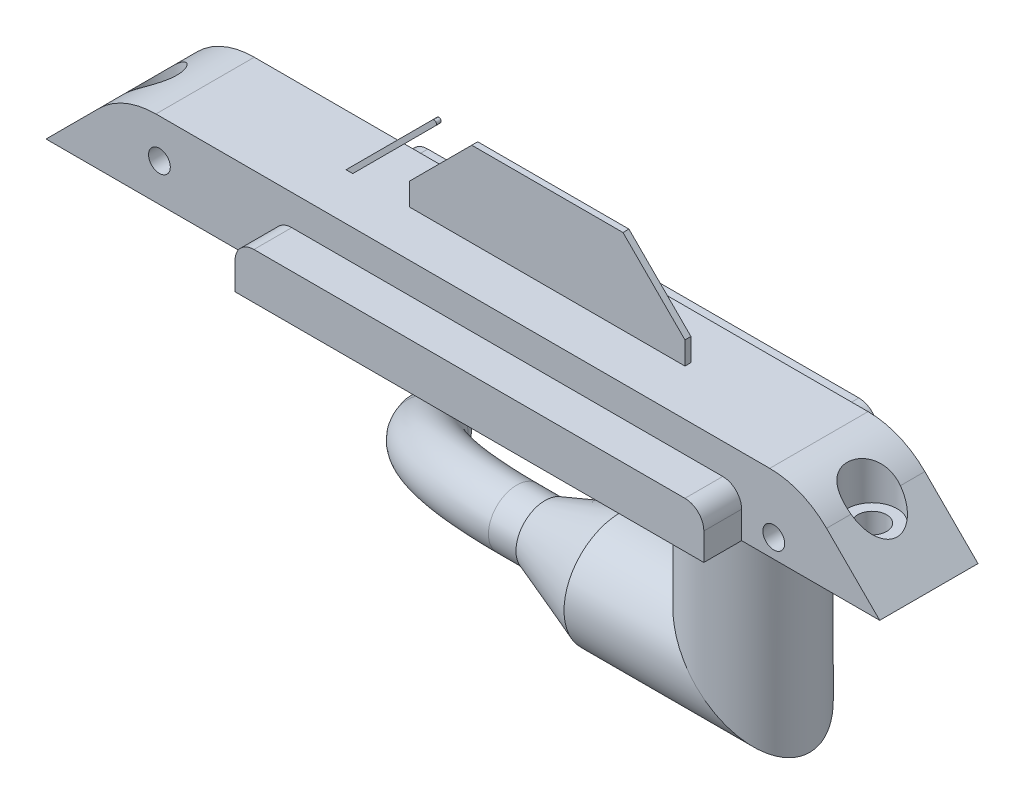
ISO-10303-21;
HEADER;
FILE_DESCRIPTION(('STEP AP214'),'2;1');
FILE_NAME('part.step','',(''),(''),'','','');
FILE_SCHEMA(('AUTOMOTIVE_DESIGN { 1 0 10303 214 1 1 1 1 }'));
ENDSEC;
DATA;
#1=APPLICATION_CONTEXT('core data for automotive mechanical design processes');
#2=APPLICATION_PROTOCOL_DEFINITION('international standard','automotive_design',2000,#1);
#3=PRODUCT_CONTEXT('',#1,'mechanical');
#4=PRODUCT('Part','Part','',(#3));
#5=PRODUCT_RELATED_PRODUCT_CATEGORY('part','',(#4));
#6=PRODUCT_DEFINITION_FORMATION('','',#4);
#7=PRODUCT_DEFINITION_CONTEXT('part definition',#1,'design');
#8=PRODUCT_DEFINITION('design','',#6,#7);
#9=PRODUCT_DEFINITION_SHAPE('','',#8);
#10=(LENGTH_UNIT() NAMED_UNIT(*) SI_UNIT(.MILLI.,.METRE.));
#11=(NAMED_UNIT(*) PLANE_ANGLE_UNIT() SI_UNIT($,.RADIAN.));
#12=(NAMED_UNIT(*) SI_UNIT($,.STERADIAN.) SOLID_ANGLE_UNIT());
#13=UNCERTAINTY_MEASURE_WITH_UNIT(LENGTH_MEASURE(1.E-05),#10,'distance_accuracy_value','');
#14=(GEOMETRIC_REPRESENTATION_CONTEXT(3) GLOBAL_UNCERTAINTY_ASSIGNED_CONTEXT((#13)) GLOBAL_UNIT_ASSIGNED_CONTEXT((#10,
#11,#12)) REPRESENTATION_CONTEXT('',''));
#15=CARTESIAN_POINT('',(0.,0.,0.));
#16=DIRECTION('',(0.,0.,1.));
#17=DIRECTION('',(1.,0.,0.));
#18=AXIS2_PLACEMENT_3D('',#15,#16,#17);
#19=CARTESIAN_POINT('',(-39.6875,-23.8125,0.));
#20=DIRECTION('',(1.,0.,0.));
#21=DIRECTION('',(0.,0.,-1.));
#22=AXIS2_PLACEMENT_3D('',#19,#20,#21);
#23=PLANE('',#22);
#24=CARTESIAN_POINT('',(-39.6875,-23.8125,0.));
#25=DIRECTION('',(1.,0.,0.));
#26=DIRECTION('',(0.,0.,-1.));
#27=AXIS2_PLACEMENT_3D('',#24,#25,#26);
#28=CIRCLE('',#27,4.90257802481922);
#29=CARTESIAN_POINT('',(-39.6875,-23.8125,-4.90257802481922));
#30=VERTEX_POINT('',#29);
#31=EDGE_CURVE('E710',#30,#30,#28,.T.);
#32=ORIENTED_EDGE('',*,*,#31,.F.);
#33=EDGE_LOOP('',(#32));
#34=FACE_BOUND('',#33,.T.);
#35=CARTESIAN_POINT('',(-39.6875,-23.8125,0.));
#36=DIRECTION('',(1.,0.,0.));
#37=DIRECTION('',(0.,0.,-1.));
#38=AXIS2_PLACEMENT_3D('',#35,#36,#37);
#39=CIRCLE('',#38,4.7625);
#40=CARTESIAN_POINT('',(-39.6875,-23.8125,-4.7625));
#41=VERTEX_POINT('',#40);
#42=EDGE_CURVE('E11',#41,#41,#39,.F.);
#43=ORIENTED_EDGE('',*,*,#42,.F.);
#44=EDGE_LOOP('',(#43));
#45=FACE_BOUND('',#44,.T.);
#46=ADVANCED_FACE('F38',(#34,#45),#23,.F.);
#47=CARTESIAN_POINT('',(-115.2652,0.,8.25500000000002));
#48=DIRECTION('',(0.,1.,0.));
#49=DIRECTION('',(0.,0.,1.));
#50=AXIS2_PLACEMENT_3D('',#47,#48,#49);
#51=PLANE('',#50);
#52=CARTESIAN_POINT('',(15.24,0.,0.));
#53=DIRECTION('',(0.,1.,0.));
#54=DIRECTION('',(0.,0.,1.));
#55=AXIS2_PLACEMENT_3D('',#52,#53,#54);
#56=CIRCLE('',#55,2.4384);
#57=CARTESIAN_POINT('',(15.24,0.,2.4384));
#58=VERTEX_POINT('',#57);
#59=EDGE_CURVE('E352',#58,#58,#56,.T.);
#60=ORIENTED_EDGE('',*,*,#59,.T.);
#61=EDGE_LOOP('',(#60));
#62=FACE_BOUND('',#61,.T.);
#63=CARTESIAN_POINT('',(-105.7402,0.,0.));
#64=DIRECTION('',(0.,1.,0.));
#65=DIRECTION('',(0.,0.,1.));
#66=AXIS2_PLACEMENT_3D('',#63,#64,#65);
#67=CIRCLE('',#66,2.43839999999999);
#68=CARTESIAN_POINT('',(-105.7402,0.,2.43839999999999));
#69=VERTEX_POINT('',#68);
#70=EDGE_CURVE('E338',#69,#69,#67,.T.);
#71=ORIENTED_EDGE('',*,*,#70,.T.);
#72=EDGE_LOOP('',(#71));
#73=FACE_BOUND('',#72,.T.);
#74=DIRECTION('',(-1.,0.,0.));
#75=VECTOR('',#74,1.);
#76=CARTESIAN_POINT('',(-115.2652,0.,-8.25499999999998));
#77=LINE('',#76,#75);
#78=CARTESIAN_POINT('',(-77.1652,0.,-8.25499999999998));
#79=VERTEX_POINT('',#78);
#80=CARTESIAN_POINT('',(-115.2652,0.,-8.25499999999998));
#81=VERTEX_POINT('',#80);
#82=EDGE_CURVE('E414',#79,#81,#77,.T.);
#83=ORIENTED_EDGE('',*,*,#82,.F.);
#84=DIRECTION('',(0.,0.,-1.));
#85=VECTOR('',#84,1.);
#86=CARTESIAN_POINT('',(-77.1652,0.,14.605));
#87=LINE('',#86,#85);
#88=CARTESIAN_POINT('',(-77.1652,0.,-14.605));
#89=VERTEX_POINT('',#88);
#90=EDGE_CURVE('E676',#79,#89,#87,.T.);
#91=ORIENTED_EDGE('',*,*,#90,.T.);
#92=DIRECTION('',(1.,0.,0.));
#93=VECTOR('',#92,1.);
#94=CARTESIAN_POINT('',(1.57480000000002,0.,-14.605));
#95=LINE('',#94,#93);
#96=CARTESIAN_POINT('',(1.57480000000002,0.,-14.605));
#97=VERTEX_POINT('',#96);
#98=EDGE_CURVE('E688',#89,#97,#95,.T.);
#99=ORIENTED_EDGE('',*,*,#98,.T.);
#100=DIRECTION('',(0.,0.,-1.));
#101=VECTOR('',#100,1.);
#102=CARTESIAN_POINT('',(1.57480000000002,0.,14.605));
#103=LINE('',#102,#101);
#104=CARTESIAN_POINT('',(1.57480000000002,0.,-8.25499999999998));
#105=VERTEX_POINT('',#104);
#106=EDGE_CURVE('E266',#105,#97,#103,.T.);
#107=ORIENTED_EDGE('',*,*,#106,.F.);
#108=CARTESIAN_POINT('',(24.765,0.,-8.25499999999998));
#109=VERTEX_POINT('',#108);
#110=EDGE_CURVE('E402',#109,#105,#77,.T.);
#111=ORIENTED_EDGE('',*,*,#110,.F.);
#112=DIRECTION('',(0.,0.,-1.));
#113=VECTOR('',#112,1.);
#114=CARTESIAN_POINT('',(24.765,0.,-8.25499999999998));
#115=LINE('',#114,#113);
#116=CARTESIAN_POINT('',(24.765,0.,8.25499999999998));
#117=VERTEX_POINT('',#116);
#118=EDGE_CURVE('E410',#117,#109,#115,.T.);
#119=ORIENTED_EDGE('',*,*,#118,.F.);
#120=DIRECTION('',(1.,0.,0.));
#121=VECTOR('',#120,1.);
#122=CARTESIAN_POINT('',(-115.2652,0.,8.25500000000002));
#123=LINE('',#122,#121);
#124=CARTESIAN_POINT('',(1.57480000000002,0.,8.25499999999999));
#125=VERTEX_POINT('',#124);
#126=EDGE_CURVE('E264',#125,#117,#123,.T.);
#127=ORIENTED_EDGE('',*,*,#126,.F.);
#128=CARTESIAN_POINT('',(1.57480000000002,0.,14.605));
#129=VERTEX_POINT('',#128);
#130=EDGE_CURVE('E242',#129,#125,#103,.T.);
#131=ORIENTED_EDGE('',*,*,#130,.F.);
#132=DIRECTION('',(1.,0.,0.));
#133=VECTOR('',#132,1.);
#134=CARTESIAN_POINT('',(1.57480000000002,0.,14.605));
#135=LINE('',#134,#133);
#136=CARTESIAN_POINT('',(-77.1652,0.,14.605));
#137=VERTEX_POINT('',#136);
#138=EDGE_CURVE('E248',#137,#129,#135,.T.);
#139=ORIENTED_EDGE('',*,*,#138,.F.);
#140=CARTESIAN_POINT('',(-77.1652,0.,8.25500000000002));
#141=VERTEX_POINT('',#140);
#142=EDGE_CURVE('E674',#137,#141,#87,.T.);
#143=ORIENTED_EDGE('',*,*,#142,.T.);
#144=CARTESIAN_POINT('',(-115.2652,0.,8.25500000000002));
#145=VERTEX_POINT('',#144);
#146=EDGE_CURVE('E408',#145,#141,#123,.T.);
#147=ORIENTED_EDGE('',*,*,#146,.F.);
#148=DIRECTION('',(0.,0.,1.));
#149=VECTOR('',#148,1.);
#150=CARTESIAN_POINT('',(-115.2652,0.,-8.25499999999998));
#151=LINE('',#150,#149);
#152=EDGE_CURVE('E397',#81,#145,#151,.T.);
#153=ORIENTED_EDGE('',*,*,#152,.F.);
#154=EDGE_LOOP('',(#83,#91,#99,#107,#111,#119,#127,#131,#139,#143,#147,#153));
#155=FACE_BOUND('',#154,.T.);
#156=CARTESIAN_POINT('',(-4.7625,0.,0.));
#157=DIRECTION('',(0.,1.,0.));
#158=DIRECTION('',(0.,0.,1.));
#159=AXIS2_PLACEMENT_3D('',#156,#157,#158);
#160=CIRCLE('',#159,9.52500000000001);
#161=CARTESIAN_POINT('',(-4.7625,0.,9.52500000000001));
#162=VERTEX_POINT('',#161);
#163=EDGE_CURVE('E47',#162,#162,#160,.F.);
#164=ORIENTED_EDGE('',*,*,#163,.F.);
#165=EDGE_LOOP('',(#164));
#166=FACE_BOUND('',#165,.T.);
#167=ADVANCED_FACE('F261',(#62,#73,#155,#166),#51,.F.);
#168=CARTESIAN_POINT('',(-115.2652,12.8778,8.25500000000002));
#169=DIRECTION('',(0.,0.,-1.));
#170=DIRECTION('',(-1.,0.,0.));
#171=AXIS2_PLACEMENT_3D('',#168,#169,#170);
#172=PLANE('',#171);
#173=CARTESIAN_POINT('',(6.9723,3.175,8.25499999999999));
#174=DIRECTION('',(0.,0.,-1.));
#175=DIRECTION('',(-1.,0.,0.));
#176=AXIS2_PLACEMENT_3D('',#173,#174,#175);
#177=CIRCLE('',#176,1.8288);
#178=CARTESIAN_POINT('',(5.1435,3.175,8.25499999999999));
#179=VERTEX_POINT('',#178);
#180=EDGE_CURVE('E702',#179,#179,#177,.T.);
#181=ORIENTED_EDGE('',*,*,#180,.T.);
#182=EDGE_LOOP('',(#181));
#183=FACE_BOUND('',#182,.T.);
#184=CARTESIAN_POINT('',(-96.2152,6.35,8.25500000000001));
#185=DIRECTION('',(0.,0.,-1.));
#186=DIRECTION('',(-1.,0.,0.));
#187=AXIS2_PLACEMENT_3D('',#184,#185,#186);
#188=CIRCLE('',#187,1.82879999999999);
#189=CARTESIAN_POINT('',(-98.044,6.35,8.25500000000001));
#190=VERTEX_POINT('',#189);
#191=EDGE_CURVE('E690',#190,#190,#188,.T.);
#192=ORIENTED_EDGE('',*,*,#191,.T.);
#193=EDGE_LOOP('',(#192));
#194=FACE_BOUND('',#193,.T.);
#195=DIRECTION('',(0.,1.,0.));
#196=VECTOR('',#195,1.);
#197=CARTESIAN_POINT('',(1.57480000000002,12.8778,8.25499999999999));
#198=LINE('',#197,#196);
#199=CARTESIAN_POINT('',(1.57480000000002,4.57199999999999,8.25499999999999));
#200=VERTEX_POINT('',#199);
#201=EDGE_CURVE('E279',#125,#200,#198,.T.);
#202=ORIENTED_EDGE('',*,*,#201,.F.);
#203=ORIENTED_EDGE('',*,*,#126,.T.);
#204=DIRECTION('',(0.707106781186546,-0.707106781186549,0.));
#205=VECTOR('',#204,1.);
#206=CARTESIAN_POINT('',(11.8872,12.8778,8.25500000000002));
#207=LINE('',#206,#205);
#208=CARTESIAN_POINT('',(15.8394278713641,8.92557212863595,8.25500000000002));
#209=VERTEX_POINT('',#208);
#210=EDGE_CURVE('E367',#209,#117,#207,.T.);
#211=ORIENTED_EDGE('',*,*,#210,.F.);
#212=CARTESIAN_POINT('',(6.29790574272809,-0.615949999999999,8.25499999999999));
#213=DIRECTION('',(0.,0.,-1.));
#214=DIRECTION('',(-1.,0.,0.));
#215=AXIS2_PLACEMENT_3D('',#212,#213,#214);
#216=CIRCLE('',#215,13.49375);
#217=CARTESIAN_POINT('',(6.29790574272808,12.8778,8.25499999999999));
#218=VERTEX_POINT('',#217);
#219=EDGE_CURVE('E430',#209,#218,#216,.F.);
#220=ORIENTED_EDGE('',*,*,#219,.T.);
#221=DIRECTION('',(1.,0.,0.));
#222=VECTOR('',#221,1.);
#223=CARTESIAN_POINT('',(-115.2652,12.8778,8.25500000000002));
#224=LINE('',#223,#222);
#225=CARTESIAN_POINT('',(-96.7981057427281,12.8778,8.25500000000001));
#226=VERTEX_POINT('',#225);
#227=EDGE_CURVE('E398',#226,#218,#224,.T.);
#228=ORIENTED_EDGE('',*,*,#227,.F.);
#229=CARTESIAN_POINT('',(-96.7981057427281,-0.615949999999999,8.25500000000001));
#230=DIRECTION('',(0.,0.,-1.));
#231=DIRECTION('',(-1.,0.,0.));
#232=AXIS2_PLACEMENT_3D('',#229,#230,#231);
#233=CIRCLE('',#232,13.49375);
#234=CARTESIAN_POINT('',(-106.339627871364,8.92557212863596,8.25500000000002));
#235=VERTEX_POINT('',#234);
#236=EDGE_CURVE('E428',#226,#235,#233,.F.);
#237=ORIENTED_EDGE('',*,*,#236,.T.);
#238=DIRECTION('',(0.707106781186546,0.707106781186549,0.));
#239=VECTOR('',#238,1.);
#240=CARTESIAN_POINT('',(-115.2652,0.,8.25500000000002));
#241=LINE('',#240,#239);
#242=EDGE_CURVE('E360',#145,#235,#241,.T.);
#243=ORIENTED_EDGE('',*,*,#242,.F.);
#244=ORIENTED_EDGE('',*,*,#146,.T.);
#245=DIRECTION('',(0.,-1.,0.));
#246=VECTOR('',#245,1.);
#247=CARTESIAN_POINT('',(-77.1652,12.8778,8.25500000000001));
#248=LINE('',#247,#246);
#249=CARTESIAN_POINT('',(-77.1652,4.57199999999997,8.25500000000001));
#250=VERTEX_POINT('',#249);
#251=EDGE_CURVE('E269',#250,#141,#248,.T.);
#252=ORIENTED_EDGE('',*,*,#251,.F.);
#253=CARTESIAN_POINT('',(-73.9902,4.57199999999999,8.25500000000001));
#254=DIRECTION('',(0.,0.,-1.));
#255=DIRECTION('',(-1.,0.,0.));
#256=AXIS2_PLACEMENT_3D('',#253,#254,#255);
#257=CIRCLE('',#256,3.175);
#258=CARTESIAN_POINT('',(-73.9902,7.74699999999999,8.25500000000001));
#259=VERTEX_POINT('',#258);
#260=EDGE_CURVE('E281',#259,#250,#257,.F.);
#261=ORIENTED_EDGE('',*,*,#260,.F.);
#262=DIRECTION('',(-1.,0.,0.));
#263=VECTOR('',#262,1.);
#264=CARTESIAN_POINT('',(-115.2652,7.74699999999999,8.25500000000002));
#265=LINE('',#264,#263);
#266=CARTESIAN_POINT('',(-1.60019999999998,7.74699999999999,8.25499999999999));
#267=VERTEX_POINT('',#266);
#268=EDGE_CURVE('E59',#267,#259,#265,.T.);
#269=ORIENTED_EDGE('',*,*,#268,.F.);
#270=CARTESIAN_POINT('',(-1.60019999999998,4.57199999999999,8.25499999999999));
#271=DIRECTION('',(0.,0.,-1.));
#272=DIRECTION('',(-1.,0.,0.));
#273=AXIS2_PLACEMENT_3D('',#270,#271,#272);
#274=CIRCLE('',#273,3.175);
#275=EDGE_CURVE('E54',#200,#267,#274,.F.);
#276=ORIENTED_EDGE('',*,*,#275,.F.);
#277=EDGE_LOOP('',(#202,#203,#211,#220,#228,#237,#243,#244,#252,#261,#269,#276));
#278=FACE_BOUND('',#277,.T.);
#279=ADVANCED_FACE('F514',(#183,#194,#278),#172,.F.);
#280=CARTESIAN_POINT('',(-115.2652,12.8778,-8.25499999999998));
#281=DIRECTION('',(0.,0.,1.));
#282=DIRECTION('',(1.,0.,0.));
#283=AXIS2_PLACEMENT_3D('',#280,#281,#282);
#284=PLANE('',#283);
#285=CARTESIAN_POINT('',(6.9723,3.175,-8.25499999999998));
#286=DIRECTION('',(0.,0.,-1.));
#287=DIRECTION('',(-1.,0.,0.));
#288=AXIS2_PLACEMENT_3D('',#285,#286,#287);
#289=CIRCLE('',#288,1.8288);
#290=CARTESIAN_POINT('',(5.1435,3.175,-8.25499999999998));
#291=VERTEX_POINT('',#290);
#292=EDGE_CURVE('E704',#291,#291,#289,.T.);
#293=ORIENTED_EDGE('',*,*,#292,.F.);
#294=EDGE_LOOP('',(#293));
#295=FACE_BOUND('',#294,.T.);
#296=CARTESIAN_POINT('',(-96.2152,6.35,-8.25499999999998));
#297=DIRECTION('',(0.,0.,-1.));
#298=DIRECTION('',(-1.,0.,0.));
#299=AXIS2_PLACEMENT_3D('',#296,#297,#298);
#300=CIRCLE('',#299,1.82879999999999);
#301=CARTESIAN_POINT('',(-98.044,6.35,-8.25499999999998));
#302=VERTEX_POINT('',#301);
#303=EDGE_CURVE('E699',#302,#302,#300,.T.);
#304=ORIENTED_EDGE('',*,*,#303,.F.);
#305=EDGE_LOOP('',(#304));
#306=FACE_BOUND('',#305,.T.);
#307=DIRECTION('',(0.,-1.,0.));
#308=VECTOR('',#307,1.);
#309=CARTESIAN_POINT('',(1.57480000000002,12.8778,-8.25499999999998));
#310=LINE('',#309,#308);
#311=CARTESIAN_POINT('',(1.57480000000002,4.57199999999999,-8.25499999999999));
#312=VERTEX_POINT('',#311);
#313=EDGE_CURVE('E276',#312,#105,#310,.T.);
#314=ORIENTED_EDGE('',*,*,#313,.F.);
#315=CARTESIAN_POINT('',(-1.60019999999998,4.57199999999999,-8.25499999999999));
#316=DIRECTION('',(0.,0.,1.));
#317=DIRECTION('',(1.,0.,0.));
#318=AXIS2_PLACEMENT_3D('',#315,#316,#317);
#319=CIRCLE('',#318,3.175);
#320=CARTESIAN_POINT('',(-1.60019999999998,7.74699999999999,-8.25499999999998));
#321=VERTEX_POINT('',#320);
#322=EDGE_CURVE('E1055',#321,#312,#319,.F.);
#323=ORIENTED_EDGE('',*,*,#322,.F.);
#324=DIRECTION('',(1.,0.,0.));
#325=VECTOR('',#324,1.);
#326=CARTESIAN_POINT('',(-115.2652,7.74699999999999,-8.25499999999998));
#327=LINE('',#326,#325);
#328=CARTESIAN_POINT('',(-73.9902,7.74699999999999,-8.25499999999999));
#329=VERTEX_POINT('',#328);
#330=EDGE_CURVE('E1053',#329,#321,#327,.T.);
#331=ORIENTED_EDGE('',*,*,#330,.F.);
#332=CARTESIAN_POINT('',(-73.9902,4.57199999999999,-8.25499999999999));
#333=DIRECTION('',(0.,0.,1.));
#334=DIRECTION('',(1.,0.,0.));
#335=AXIS2_PLACEMENT_3D('',#332,#333,#334);
#336=CIRCLE('',#335,3.175);
#337=CARTESIAN_POINT('',(-77.1652,4.57199999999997,-8.25499999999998));
#338=VERTEX_POINT('',#337);
#339=EDGE_CURVE('E629',#338,#329,#336,.F.);
#340=ORIENTED_EDGE('',*,*,#339,.F.);
#341=DIRECTION('',(0.,1.,0.));
#342=VECTOR('',#341,1.);
#343=CARTESIAN_POINT('',(-77.1652,12.8778,-8.25499999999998));
#344=LINE('',#343,#342);
#345=EDGE_CURVE('E265',#79,#338,#344,.T.);
#346=ORIENTED_EDGE('',*,*,#345,.F.);
#347=ORIENTED_EDGE('',*,*,#82,.T.);
#348=DIRECTION('',(0.707106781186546,0.707106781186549,0.));
#349=VECTOR('',#348,1.);
#350=CARTESIAN_POINT('',(-115.2652,0.,-8.25499999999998));
#351=LINE('',#350,#349);
#352=CARTESIAN_POINT('',(-106.339627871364,8.92557212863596,-8.25499999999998));
#353=VERTEX_POINT('',#352);
#354=EDGE_CURVE('E363',#81,#353,#351,.T.);
#355=ORIENTED_EDGE('',*,*,#354,.T.);
#356=CARTESIAN_POINT('',(-96.7981057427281,-0.615949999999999,-8.25499999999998));
#357=DIRECTION('',(0.,0.,1.));
#358=DIRECTION('',(1.,0.,0.));
#359=AXIS2_PLACEMENT_3D('',#356,#357,#358);
#360=CIRCLE('',#359,13.49375);
#361=CARTESIAN_POINT('',(-96.7981057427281,12.8778,-8.25499999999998));
#362=VERTEX_POINT('',#361);
#363=EDGE_CURVE('E437',#353,#362,#360,.F.);
#364=ORIENTED_EDGE('',*,*,#363,.T.);
#365=DIRECTION('',(-1.,0.,0.));
#366=VECTOR('',#365,1.);
#367=CARTESIAN_POINT('',(-115.2652,12.8778,-8.25499999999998));
#368=LINE('',#367,#366);
#369=CARTESIAN_POINT('',(6.29790574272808,12.8778,-8.25499999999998));
#370=VERTEX_POINT('',#369);
#371=EDGE_CURVE('E401',#370,#362,#368,.T.);
#372=ORIENTED_EDGE('',*,*,#371,.F.);
#373=CARTESIAN_POINT('',(6.29790574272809,-0.615949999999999,-8.25499999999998));
#374=DIRECTION('',(0.,0.,1.));
#375=DIRECTION('',(1.,0.,0.));
#376=AXIS2_PLACEMENT_3D('',#373,#374,#375);
#377=CIRCLE('',#376,13.49375);
#378=CARTESIAN_POINT('',(15.8394278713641,8.92557212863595,-8.25499999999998));
#379=VERTEX_POINT('',#378);
#380=EDGE_CURVE('E439',#370,#379,#377,.F.);
#381=ORIENTED_EDGE('',*,*,#380,.T.);
#382=DIRECTION('',(0.707106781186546,-0.707106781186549,0.));
#383=VECTOR('',#382,1.);
#384=CARTESIAN_POINT('',(11.8872,12.8778,-8.25499999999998));
#385=LINE('',#384,#383);
#386=EDGE_CURVE('E370',#379,#109,#385,.T.);
#387=ORIENTED_EDGE('',*,*,#386,.T.);
#388=ORIENTED_EDGE('',*,*,#110,.T.);
#389=EDGE_LOOP('',(#314,#323,#331,#340,#346,#347,#355,#364,#372,#381,#387,#388));
#390=FACE_BOUND('',#389,.T.);
#391=ADVANCED_FACE('F510',(#295,#306,#390),#284,.F.);
#392=CARTESIAN_POINT('',(-115.2652,12.8778,8.25500000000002));
#393=DIRECTION('',(0.,1.,0.));
#394=DIRECTION('',(0.,0.,1.));
#395=AXIS2_PLACEMENT_3D('',#392,#393,#394);
#396=PLANE('',#395);
#397=DIRECTION('',(0.,0.,1.));
#398=VECTOR('',#397,1.);
#399=CARTESIAN_POINT('',(-71.5976679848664,12.8778,8.25500000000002));
#400=LINE('',#399,#398);
#401=CARTESIAN_POINT('',(-71.5976679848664,12.8778,-0.396875));
#402=VERTEX_POINT('',#401);
#403=CARTESIAN_POINT('',(-71.5976679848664,12.8778,0.396875));
#404=VERTEX_POINT('',#403);
#405=EDGE_CURVE('E419',#402,#404,#400,.T.);
#406=ORIENTED_EDGE('',*,*,#405,.T.);
#407=DIRECTION('',(-1.,0.,0.));
#408=VECTOR('',#407,1.);
#409=CARTESIAN_POINT('',(-115.2652,12.8778,0.396875));
#410=LINE('',#409,#408);
#411=CARTESIAN_POINT('',(-72.7202,12.8778,0.396875));
#412=VERTEX_POINT('',#411);
#413=EDGE_CURVE('E421',#404,#412,#410,.T.);
#414=ORIENTED_EDGE('',*,*,#413,.T.);
#415=DIRECTION('',(0.,0.,-1.));
#416=VECTOR('',#415,1.);
#417=CARTESIAN_POINT('',(-72.7202,12.8778,0.396875));
#418=LINE('',#417,#416);
#419=CARTESIAN_POINT('',(-72.7202,12.8778,-0.396875));
#420=VERTEX_POINT('',#419);
#421=EDGE_CURVE('E392',#412,#420,#418,.T.);
#422=ORIENTED_EDGE('',*,*,#421,.T.);
#423=DIRECTION('',(-1.,0.,0.));
#424=VECTOR('',#423,1.);
#425=CARTESIAN_POINT('',(-115.2652,12.8778,-0.396875));
#426=LINE('',#425,#424);
#427=EDGE_CURVE('E405',#402,#420,#426,.T.);
#428=ORIENTED_EDGE('',*,*,#427,.F.);
#429=EDGE_LOOP('',(#406,#414,#422,#428));
#430=FACE_BOUND('',#429,.T.);
#431=ORIENTED_EDGE('',*,*,#227,.T.);
#432=DIRECTION('',(0.,0.,1.));
#433=VECTOR('',#432,1.);
#434=CARTESIAN_POINT('',(6.29790574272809,12.8778,-8.25499999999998));
#435=LINE('',#434,#433);
#436=EDGE_CURVE('E435',#218,#370,#435,.F.);
#437=ORIENTED_EDGE('',*,*,#436,.T.);
#438=ORIENTED_EDGE('',*,*,#371,.T.);
#439=DIRECTION('',(0.,0.,1.));
#440=VECTOR('',#439,1.);
#441=CARTESIAN_POINT('',(-96.7981057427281,12.8778,8.25500000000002));
#442=LINE('',#441,#440);
#443=EDGE_CURVE('E432',#362,#226,#442,.T.);
#444=ORIENTED_EDGE('',*,*,#443,.T.);
#445=EDGE_LOOP('',(#431,#437,#438,#444));
#446=FACE_BOUND('',#445,.T.);
#447=DIRECTION('',(0.,0.,-1.));
#448=VECTOR('',#447,1.);
#449=CARTESIAN_POINT('',(-15.6972,12.8778,0.5));
#450=LINE('',#449,#448);
#451=CARTESIAN_POINT('',(-15.6972,12.8778,0.5));
#452=VERTEX_POINT('',#451);
#453=CARTESIAN_POINT('',(-15.6972,12.8778,-0.5));
#454=VERTEX_POINT('',#453);
#455=EDGE_CURVE('E324',#452,#454,#450,.T.);
#456=ORIENTED_EDGE('',*,*,#455,.F.);
#457=DIRECTION('',(1.,0.,0.));
#458=VECTOR('',#457,1.);
#459=CARTESIAN_POINT('',(-61.9252,12.8778,0.5));
#460=LINE('',#459,#458);
#461=CARTESIAN_POINT('',(-61.9252,12.8778,0.5));
#462=VERTEX_POINT('',#461);
#463=EDGE_CURVE('E294',#462,#452,#460,.T.);
#464=ORIENTED_EDGE('',*,*,#463,.F.);
#465=DIRECTION('',(0.,0.,-1.));
#466=VECTOR('',#465,1.);
#467=CARTESIAN_POINT('',(-61.9252,12.8778,0.5));
#468=LINE('',#467,#466);
#469=CARTESIAN_POINT('',(-61.9252,12.8778,-0.5));
#470=VERTEX_POINT('',#469);
#471=EDGE_CURVE('E327',#462,#470,#468,.T.);
#472=ORIENTED_EDGE('',*,*,#471,.T.);
#473=DIRECTION('',(1.,0.,0.));
#474=VECTOR('',#473,1.);
#475=CARTESIAN_POINT('',(-61.9252,12.8778,-0.5));
#476=LINE('',#475,#474);
#477=EDGE_CURVE('E309',#470,#454,#476,.T.);
#478=ORIENTED_EDGE('',*,*,#477,.T.);
#479=EDGE_LOOP('',(#456,#464,#472,#478));
#480=FACE_BOUND('',#479,.T.);
#481=ADVANCED_FACE('F506',(#430,#446,#480),#396,.T.);
#482=CARTESIAN_POINT('',(-57.934933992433,27.1018,0.396875));
#483=DIRECTION('',(0.,0.,-1.));
#484=DIRECTION('',(-1.,0.,0.));
#485=AXIS2_PLACEMENT_3D('',#482,#483,#484);
#486=CYLINDRICAL_SURFACE('',#485,0.396875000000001);
#487=CARTESIAN_POINT('',(-57.934933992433,27.1018,-0.396875));
#488=DIRECTION('',(0.,0.,1.));
#489=DIRECTION('',(-1.,0.,0.));
#490=AXIS2_PLACEMENT_3D('',#487,#488,#489);
#491=CIRCLE('',#490,0.396875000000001);
#492=CARTESIAN_POINT('',(-57.6543009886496,26.8211669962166,-0.396875));
#493=VERTEX_POINT('',#492);
#494=CARTESIAN_POINT('',(-58.2155669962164,27.3824330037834,-0.396875));
#495=VERTEX_POINT('',#494);
#496=EDGE_CURVE('E373',#493,#495,#491,.T.);
#497=ORIENTED_EDGE('',*,*,#496,.T.);
#498=DIRECTION('',(0.,0.,-1.));
#499=VECTOR('',#498,1.);
#500=CARTESIAN_POINT('',(-58.2155669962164,27.3824330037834,0.396875));
#501=LINE('',#500,#499);
#502=CARTESIAN_POINT('',(-58.2155669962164,27.3824330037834,0.396875));
#503=VERTEX_POINT('',#502);
#504=EDGE_CURVE('E394',#503,#495,#501,.T.);
#505=ORIENTED_EDGE('',*,*,#504,.F.);
#506=CARTESIAN_POINT('',(-57.934933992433,27.1018,0.396875));
#507=DIRECTION('',(0.,0.,1.));
#508=DIRECTION('',(-1.,0.,0.));
#509=AXIS2_PLACEMENT_3D('',#506,#507,#508);
#510=CIRCLE('',#509,0.396875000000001);
#511=CARTESIAN_POINT('',(-57.6543009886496,26.8211669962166,0.396875));
#512=VERTEX_POINT('',#511);
#513=EDGE_CURVE('E374',#512,#503,#510,.T.);
#514=ORIENTED_EDGE('',*,*,#513,.F.);
#515=DIRECTION('',(0.,0.,-1.));
#516=VECTOR('',#515,1.);
#517=CARTESIAN_POINT('',(-57.6543009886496,26.8211669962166,0.396875));
#518=LINE('',#517,#516);
#519=EDGE_CURVE('E383',#512,#493,#518,.T.);
#520=ORIENTED_EDGE('',*,*,#519,.T.);
#521=EDGE_LOOP('',(#497,#505,#514,#520));
#522=FACE_BOUND('',#521,.T.);
#523=ADVANCED_FACE('F502',(#522),#486,.T.);
#524=CARTESIAN_POINT('',(-58.2155669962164,27.3824330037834,0.396875));
#525=DIRECTION('',(0.707106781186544,-0.707106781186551,0.));
#526=DIRECTION('',(0.707106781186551,0.707106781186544,0.));
#527=AXIS2_PLACEMENT_3D('',#524,#525,#526);
#528=PLANE('',#527);
#529=DIRECTION('',(-0.707106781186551,-0.707106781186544,0.));
#530=VECTOR('',#529,1.);
#531=CARTESIAN_POINT('',(-58.2155669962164,27.3824330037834,-0.396875));
#532=LINE('',#531,#530);
#533=EDGE_CURVE('E386',#495,#420,#532,.T.);
#534=ORIENTED_EDGE('',*,*,#533,.T.);
#535=ORIENTED_EDGE('',*,*,#421,.F.);
#536=DIRECTION('',(-0.707106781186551,-0.707106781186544,0.));
#537=VECTOR('',#536,1.);
#538=CARTESIAN_POINT('',(-58.2155669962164,27.3824330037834,0.396875));
#539=LINE('',#538,#537);
#540=EDGE_CURVE('E377',#503,#412,#539,.T.);
#541=ORIENTED_EDGE('',*,*,#540,.F.);
#542=ORIENTED_EDGE('',*,*,#504,.T.);
#543=EDGE_LOOP('',(#534,#535,#541,#542));
#544=FACE_BOUND('',#543,.T.);
#545=ADVANCED_FACE('F498',(#544),#528,.F.);
#546=CARTESIAN_POINT('',(-57.6543009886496,26.8211669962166,0.396875));
#547=DIRECTION('',(-0.707106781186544,0.707106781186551,0.));
#548=DIRECTION('',(-0.707106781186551,-0.707106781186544,0.));
#549=AXIS2_PLACEMENT_3D('',#546,#547,#548);
#550=PLANE('',#549);
#551=ORIENTED_EDGE('',*,*,#405,.F.);
#552=DIRECTION('',(0.707106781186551,0.707106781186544,0.));
#553=VECTOR('',#552,1.);
#554=CARTESIAN_POINT('',(-57.6543009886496,26.8211669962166,-0.396875));
#555=LINE('',#554,#553);
#556=EDGE_CURVE('E378',#402,#493,#555,.T.);
#557=ORIENTED_EDGE('',*,*,#556,.T.);
#558=ORIENTED_EDGE('',*,*,#519,.F.);
#559=DIRECTION('',(0.707106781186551,0.707106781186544,0.));
#560=VECTOR('',#559,1.);
#561=CARTESIAN_POINT('',(-57.6543009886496,26.8211669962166,0.396875));
#562=LINE('',#561,#560);
#563=EDGE_CURVE('E381',#404,#512,#562,.T.);
#564=ORIENTED_EDGE('',*,*,#563,.F.);
#565=EDGE_LOOP('',(#551,#557,#558,#564));
#566=FACE_BOUND('',#565,.T.);
#567=ADVANCED_FACE('F491',(#566),#550,.F.);
#568=CARTESIAN_POINT('',(-57.934933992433,27.1018,0.396875));
#569=DIRECTION('',(0.,0.,-1.));
#570=DIRECTION('',(-1.,0.,0.));
#571=AXIS2_PLACEMENT_3D('',#568,#569,#570);
#572=PLANE('',#571);
#573=ORIENTED_EDGE('',*,*,#413,.F.);
#574=ORIENTED_EDGE('',*,*,#563,.T.);
#575=ORIENTED_EDGE('',*,*,#513,.T.);
#576=ORIENTED_EDGE('',*,*,#540,.T.);
#577=EDGE_LOOP('',(#573,#574,#575,#576));
#578=FACE_BOUND('',#577,.T.);
#579=ADVANCED_FACE('F488',(#578),#572,.F.);
#580=CARTESIAN_POINT('',(-57.934933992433,27.1018,-0.396875));
#581=DIRECTION('',(0.,0.,-1.));
#582=DIRECTION('',(-1.,0.,0.));
#583=AXIS2_PLACEMENT_3D('',#580,#581,#582);
#584=PLANE('',#583);
#585=ORIENTED_EDGE('',*,*,#556,.F.);
#586=ORIENTED_EDGE('',*,*,#427,.T.);
#587=ORIENTED_EDGE('',*,*,#533,.F.);
#588=ORIENTED_EDGE('',*,*,#496,.F.);
#589=EDGE_LOOP('',(#585,#586,#587,#588));
#590=FACE_BOUND('',#589,.T.);
#591=ADVANCED_FACE('F486',(#590),#584,.T.);
#592=CARTESIAN_POINT('',(11.8872,12.8778,-8.25499999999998));
#593=DIRECTION('',(-0.707106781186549,-0.707106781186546,0.));
#594=DIRECTION('',(0.707106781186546,-0.707106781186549,0.));
#595=AXIS2_PLACEMENT_3D('',#592,#593,#594);
#596=PLANE('',#595);
#597=DIRECTION('',(0.,0.,1.));
#598=VECTOR('',#597,1.);
#599=CARTESIAN_POINT('',(15.8394278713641,8.92557212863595,8.25500000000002));
#600=LINE('',#599,#598);
#601=CARTESIAN_POINT('',(15.8394278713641,8.92557212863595,-4.14791118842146));
#602=VERTEX_POINT('',#601);
#603=EDGE_CURVE('E424',#379,#602,#600,.T.);
#604=ORIENTED_EDGE('',*,*,#603,.T.);
#605=CARTESIAN_POINT('',(15.24,9.52500000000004,0.));
#606=DIRECTION('',(-0.707106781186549,-0.707106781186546,0.));
#607=DIRECTION('',(-0.707106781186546,0.707106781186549,0.));
#608=AXIS2_PLACEMENT_3D('',#605,#606,#607);
#609=ELLIPSE('',#608,5.92696903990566,4.191);
#610=CARTESIAN_POINT('',(15.8394278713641,8.92557212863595,4.14791118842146));
#611=VERTEX_POINT('',#610);
#612=EDGE_CURVE('E356',#602,#611,#609,.T.);
#613=ORIENTED_EDGE('',*,*,#612,.T.);
#614=EDGE_CURVE('E423',#611,#209,#600,.T.);
#615=ORIENTED_EDGE('',*,*,#614,.T.);
#616=ORIENTED_EDGE('',*,*,#210,.T.);
#617=ORIENTED_EDGE('',*,*,#118,.T.);
#618=ORIENTED_EDGE('',*,*,#386,.F.);
#619=EDGE_LOOP('',(#604,#613,#615,#616,#617,#618));
#620=FACE_BOUND('',#619,.T.);
#621=ADVANCED_FACE('F482',(#620),#596,.F.);
#622=CARTESIAN_POINT('',(-115.2652,0.,-8.25499999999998));
#623=DIRECTION('',(0.707106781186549,-0.707106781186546,0.));
#624=DIRECTION('',(0.707106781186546,0.707106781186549,0.));
#625=AXIS2_PLACEMENT_3D('',#622,#623,#624);
#626=PLANE('',#625);
#627=DIRECTION('',(0.,0.,1.));
#628=VECTOR('',#627,1.);
#629=CARTESIAN_POINT('',(-106.339627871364,8.92557212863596,-8.25499999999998));
#630=LINE('',#629,#628);
#631=CARTESIAN_POINT('',(-106.339627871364,8.92557212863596,4.14791118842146));
#632=VERTEX_POINT('',#631);
#633=EDGE_CURVE('E443',#235,#632,#630,.F.);
#634=ORIENTED_EDGE('',*,*,#633,.T.);
#635=CARTESIAN_POINT('',(-105.7402,9.52500000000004,0.));
#636=DIRECTION('',(0.707106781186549,-0.707106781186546,0.));
#637=DIRECTION('',(0.707106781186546,0.707106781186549,0.));
#638=AXIS2_PLACEMENT_3D('',#635,#636,#637);
#639=ELLIPSE('',#638,5.92696903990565,4.191);
#640=CARTESIAN_POINT('',(-106.339627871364,8.92557212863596,-4.14791118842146));
#641=VERTEX_POINT('',#640);
#642=EDGE_CURVE('E341',#632,#641,#639,.T.);
#643=ORIENTED_EDGE('',*,*,#642,.T.);
#644=EDGE_CURVE('E442',#641,#353,#630,.F.);
#645=ORIENTED_EDGE('',*,*,#644,.T.);
#646=ORIENTED_EDGE('',*,*,#354,.F.);
#647=ORIENTED_EDGE('',*,*,#152,.T.);
#648=ORIENTED_EDGE('',*,*,#242,.T.);
#649=EDGE_LOOP('',(#634,#643,#645,#646,#647,#648));
#650=FACE_BOUND('',#649,.T.);
#651=ADVANCED_FACE('F479',(#650),#626,.F.);
#652=CARTESIAN_POINT('',(6.29790574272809,-0.615949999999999,-8.25499999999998));
#653=DIRECTION('',(0.,0.,-1.));
#654=DIRECTION('',(-1.,0.,0.));
#655=AXIS2_PLACEMENT_3D('',#652,#653,#654);
#656=CYLINDRICAL_SURFACE('',#655,13.49375);
#657=CARTESIAN_POINT('',(15.8394278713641,8.92557212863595,-4.14791118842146));
#658=CARTESIAN_POINT('',(15.7150457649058,9.04998932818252,-4.16587880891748));
#659=CARTESIAN_POINT('',(15.5877491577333,9.17238626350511,-4.1785673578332));
#660=CARTESIAN_POINT('',(15.3278750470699,9.4126160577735,-4.19210499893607));
#661=CARTESIAN_POINT('',(15.1952878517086,9.53043967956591,-4.19293125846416));
#662=CARTESIAN_POINT('',(14.9249044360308,9.76133532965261,-4.18134263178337));
#663=CARTESIAN_POINT('',(14.7870778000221,9.87436745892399,-4.16883323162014));
#664=CARTESIAN_POINT('',(14.5084554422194,10.0938374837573,-4.12905580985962));
#665=CARTESIAN_POINT('',(14.3676622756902,10.2002807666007,-4.10180002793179));
#666=CARTESIAN_POINT('',(14.1206047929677,10.3796728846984,-4.04020773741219));
#667=CARTESIAN_POINT('',(14.0146428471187,10.4542679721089,-4.00942210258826));
#668=CARTESIAN_POINT('',(13.8028056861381,10.5989598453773,-3.93845457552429));
#669=CARTESIAN_POINT('',(13.6969304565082,10.6690576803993,-3.89827488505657));
#670=CARTESIAN_POINT('',(13.4865112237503,10.8042444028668,-3.80825658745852));
#671=CARTESIAN_POINT('',(13.3819644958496,10.8693457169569,-3.75844310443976));
#672=CARTESIAN_POINT('',(13.1750875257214,10.9944014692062,-3.64887781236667));
#673=CARTESIAN_POINT('',(13.0727562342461,11.0543583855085,-3.5891308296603));
#674=CARTESIAN_POINT('',(12.8706351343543,11.1693863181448,-3.45906802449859));
#675=CARTESIAN_POINT('',(12.7708736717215,11.2244123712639,-3.38866814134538));
#676=CARTESIAN_POINT('',(12.5761550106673,11.3288009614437,-3.23783391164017));
#677=CARTESIAN_POINT('',(12.4811956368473,11.3781660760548,-3.15740416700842));
#678=CARTESIAN_POINT('',(12.2973146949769,11.4711923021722,-2.98677515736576));
#679=CARTESIAN_POINT('',(12.2083971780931,11.5148496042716,-2.89656944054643));
#680=CARTESIAN_POINT('',(12.0379931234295,11.5964048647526,-2.707003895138));
#681=CARTESIAN_POINT('',(11.9565056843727,11.6343035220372,-2.60764517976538));
#682=CARTESIAN_POINT('',(11.8108940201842,11.7004580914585,-2.41222848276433));
#683=CARTESIAN_POINT('',(11.7458479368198,11.7293193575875,-2.31706011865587));
#684=CARTESIAN_POINT('',(11.6233566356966,11.7826517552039,-2.12078985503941));
#685=CARTESIAN_POINT('',(11.5659107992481,11.8071232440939,-2.01968843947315));
#686=CARTESIAN_POINT('',(11.4593289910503,11.8517819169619,-1.81234420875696));
#687=CARTESIAN_POINT('',(11.4101897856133,11.8719707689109,-1.70610341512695));
#688=CARTESIAN_POINT('',(11.3207779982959,11.9082015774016,-1.48927194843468));
#689=CARTESIAN_POINT('',(11.2805051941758,11.9242436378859,-1.37868138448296));
#690=CARTESIAN_POINT('',(11.2113594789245,11.9514905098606,-1.16054373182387));
#691=CARTESIAN_POINT('',(11.1819617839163,11.9629215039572,-1.05319079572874));
#692=CARTESIAN_POINT('',(11.131746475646,11.982303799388,-0.836148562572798));
#693=CARTESIAN_POINT('',(11.1109317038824,11.9902539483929,-0.726458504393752));
#694=CARTESIAN_POINT('',(11.0781159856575,12.0027340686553,-0.505626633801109));
#695=CARTESIAN_POINT('',(11.0661110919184,12.0072655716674,-0.394485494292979));
#696=CARTESIAN_POINT('',(11.0510176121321,12.0129566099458,-0.17147182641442));
#697=CARTESIAN_POINT('',(11.0479323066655,12.0141149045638,-0.0595990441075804));
#698=CARTESIAN_POINT('',(11.0507001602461,12.0130735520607,0.16257642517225));
#699=CARTESIAN_POINT('',(11.0564386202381,12.0109169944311,0.272880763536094));
#700=CARTESIAN_POINT('',(11.0765899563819,12.0033044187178,0.492620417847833));
#701=CARTESIAN_POINT('',(11.0910059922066,11.9978471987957,0.602055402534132));
#702=CARTESIAN_POINT('',(11.1283656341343,11.9835874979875,0.819191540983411));
#703=CARTESIAN_POINT('',(11.1513057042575,11.9747864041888,0.926893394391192));
#704=CARTESIAN_POINT('',(11.2054964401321,11.953763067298,1.13988685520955));
#705=CARTESIAN_POINT('',(11.236750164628,11.9415395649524,1.24517755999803));
#706=CARTESIAN_POINT('',(11.3072347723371,11.9135889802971,1.452523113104));
#707=CARTESIAN_POINT('',(11.346462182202,11.8978634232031,1.55457934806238));
#708=CARTESIAN_POINT('',(11.432518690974,11.86279982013,1.7548357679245));
#709=CARTESIAN_POINT('',(11.4793505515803,11.8434604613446,1.85303453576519));
#710=CARTESIAN_POINT('',(11.5801007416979,11.8010821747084,2.044834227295));
#711=CARTESIAN_POINT('',(11.6340158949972,11.7780449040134,2.13843718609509));
#712=CARTESIAN_POINT('',(11.7484077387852,11.7281664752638,2.32052387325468));
#713=CARTESIAN_POINT('',(11.8088868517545,11.7013239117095,2.40900569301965));
#714=CARTESIAN_POINT('',(11.9364518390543,11.6434560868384,2.58121096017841));
#715=CARTESIAN_POINT('',(12.0036019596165,11.6123888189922,2.66487276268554));
#716=CARTESIAN_POINT('',(12.1432422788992,11.5462585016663,2.82594339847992));
#717=CARTESIAN_POINT('',(12.2157343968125,11.5111940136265,2.90334996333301));
#718=CARTESIAN_POINT('',(12.4400645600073,11.399993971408,3.12554320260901));
#719=CARTESIAN_POINT('',(12.5988723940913,11.3178005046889,3.26045797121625));
#720=CARTESIAN_POINT('',(12.936098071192,11.1336985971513,3.50745918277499));
#721=CARTESIAN_POINT('',(13.1150816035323,11.0310579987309,3.61821238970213));
#722=CARTESIAN_POINT('',(13.4795028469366,10.8099592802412,3.80886442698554));
#723=CARTESIAN_POINT('',(13.6649421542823,10.6914972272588,3.88875556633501));
#724=CARTESIAN_POINT('',(14.0579374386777,10.4260463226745,4.02684510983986));
#725=CARTESIAN_POINT('',(14.2655750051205,10.2773429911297,4.08147401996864));
#726=CARTESIAN_POINT('',(14.6757903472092,9.96511439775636,4.15809681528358));
#727=CARTESIAN_POINT('',(14.8783625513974,9.8015736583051,4.18005619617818));
#728=CARTESIAN_POINT('',(15.2083039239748,9.51896094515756,4.19296720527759));
#729=CARTESIAN_POINT('',(15.3382922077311,9.40317304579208,4.19179848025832));
#730=CARTESIAN_POINT('',(15.5929010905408,9.1674250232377,4.17804913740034));
#731=CARTESIAN_POINT('',(15.71754029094,9.04748252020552,4.16551211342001));
#732=CARTESIAN_POINT('',(15.8394278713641,8.92557212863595,4.14791118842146));
#733=B_SPLINE_CURVE_WITH_KNOTS('',3,(#657,#658,#659,#660,#661,#662,#663,#664,#665,#666,#667,
#668,#669,#670,#671,#672,#673,#674,#675,#676,#677,#678,#679,#680,#681,#682,#683,#684,#685,#686,
#687,#688,#689,#690,#691,#692,#693,#694,#695,#696,#697,#698,#699,#700,#701,#702,#703,#704,#705,
#706,#707,#708,#709,#710,#711,#712,#713,#714,#715,#716,#717,#718,#719,#720,#721,#722,#723,#724,
#725,#726,#727,#728,#729,#730,#731,#732),.UNSPECIFIED.,.F.,.F.,(4,2,2,2,2,2,2,2,2,2,2,2,2,2,2,2,
2,2,2,2,2,2,2,2,2,2,2,2,2,2,2,2,2,2,2,2,2,4),(0.,0.530554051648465,1.06212918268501,
1.59749695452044,2.13242104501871,2.53162950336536,2.93074448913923,3.32883232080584,
3.72672729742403,4.12794372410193,4.52897673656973,4.93027604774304,5.33152661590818,
5.68756409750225,6.04357257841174,6.39944214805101,6.75530279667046,7.09057279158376,
7.42595369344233,7.7611842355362,8.09653805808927,8.4275693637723,8.75872127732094,
9.08973597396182,9.42087262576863,9.75186534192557,10.0829785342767,10.4139437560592,
10.7450315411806,11.0796917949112,11.4144728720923,12.0834423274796,12.7831398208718,
13.4830115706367,14.2636873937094,15.0451871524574,15.566966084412,16.0867525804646),.UNSPECIFIED.);
#734=EDGE_CURVE('E446',#602,#611,#733,.T.);
#735=ORIENTED_EDGE('',*,*,#734,.F.);
#736=ORIENTED_EDGE('',*,*,#603,.F.);
#737=ORIENTED_EDGE('',*,*,#380,.F.);
#738=ORIENTED_EDGE('',*,*,#436,.F.);
#739=ORIENTED_EDGE('',*,*,#219,.F.);
#740=ORIENTED_EDGE('',*,*,#614,.F.);
#741=EDGE_LOOP('',(#735,#736,#737,#738,#739,#740));
#742=FACE_BOUND('',#741,.T.);
#743=ADVANCED_FACE('F459',(#742),#656,.T.);
#744=CARTESIAN_POINT('',(-96.7981057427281,-0.615949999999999,8.25500000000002));
#745=DIRECTION('',(0.,0.,-1.));
#746=DIRECTION('',(-1.,0.,0.));
#747=AXIS2_PLACEMENT_3D('',#744,#745,#746);
#748=CYLINDRICAL_SURFACE('',#747,13.49375);
#749=CARTESIAN_POINT('',(-106.339627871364,8.92557212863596,4.14791118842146));
#750=CARTESIAN_POINT('',(-106.215245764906,9.04998932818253,4.16587880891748));
#751=CARTESIAN_POINT('',(-106.087949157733,9.17238626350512,4.1785673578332));
#752=CARTESIAN_POINT('',(-105.82807504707,9.4126160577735,4.19210499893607));
#753=CARTESIAN_POINT('',(-105.695487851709,9.53043967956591,4.19293125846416));
#754=CARTESIAN_POINT('',(-105.425104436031,9.76133532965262,4.18134263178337));
#755=CARTESIAN_POINT('',(-105.287277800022,9.874367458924,4.16883323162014));
#756=CARTESIAN_POINT('',(-105.008655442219,10.0938374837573,4.12905580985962));
#757=CARTESIAN_POINT('',(-104.86786227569,10.2002807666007,4.10180002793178));
#758=CARTESIAN_POINT('',(-104.620804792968,10.3796728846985,4.04020773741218));
#759=CARTESIAN_POINT('',(-104.514842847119,10.4542679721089,4.00942210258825));
#760=CARTESIAN_POINT('',(-104.303005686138,10.5989598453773,3.93845457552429));
#761=CARTESIAN_POINT('',(-104.197130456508,10.6690576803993,3.89827488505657));
#762=CARTESIAN_POINT('',(-103.98671122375,10.8042444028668,3.80825658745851));
#763=CARTESIAN_POINT('',(-103.88216449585,10.8693457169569,3.75844310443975));
#764=CARTESIAN_POINT('',(-103.675287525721,10.9944014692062,3.64887781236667));
#765=CARTESIAN_POINT('',(-103.572956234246,11.0543583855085,3.58913082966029));
#766=CARTESIAN_POINT('',(-103.370835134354,11.1693863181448,3.45906802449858));
#767=CARTESIAN_POINT('',(-103.271073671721,11.2244123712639,3.38866814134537));
#768=CARTESIAN_POINT('',(-103.076355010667,11.3288009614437,3.23783391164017));
#769=CARTESIAN_POINT('',(-102.981395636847,11.3781660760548,3.15740416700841));
#770=CARTESIAN_POINT('',(-102.797514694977,11.4711923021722,2.98677515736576));
#771=CARTESIAN_POINT('',(-102.708597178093,11.5148496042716,2.89656944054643));
#772=CARTESIAN_POINT('',(-102.53819312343,11.5964048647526,2.707003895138));
#773=CARTESIAN_POINT('',(-102.456705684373,11.6343035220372,2.60764517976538));
#774=CARTESIAN_POINT('',(-102.311094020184,11.7004580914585,2.41222848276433));
#775=CARTESIAN_POINT('',(-102.24604793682,11.7293193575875,2.31706011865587));
#776=CARTESIAN_POINT('',(-102.123556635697,11.7826517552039,2.12078985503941));
#777=CARTESIAN_POINT('',(-102.066110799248,11.8071232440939,2.01968843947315));
#778=CARTESIAN_POINT('',(-101.95952899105,11.8517819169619,1.81234420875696));
#779=CARTESIAN_POINT('',(-101.910389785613,11.8719707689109,1.70610341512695));
#780=CARTESIAN_POINT('',(-101.820977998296,11.9082015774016,1.48927194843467));
#781=CARTESIAN_POINT('',(-101.780705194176,11.9242436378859,1.37868138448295));
#782=CARTESIAN_POINT('',(-101.711559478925,11.9514905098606,1.16054373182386));
#783=CARTESIAN_POINT('',(-101.682161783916,11.9629215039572,1.05319079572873));
#784=CARTESIAN_POINT('',(-101.631946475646,11.982303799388,0.836148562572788));
#785=CARTESIAN_POINT('',(-101.611131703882,11.9902539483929,0.726458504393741));
#786=CARTESIAN_POINT('',(-101.578315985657,12.0027340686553,0.505626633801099));
#787=CARTESIAN_POINT('',(-101.566311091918,12.0072655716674,0.39448549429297));
#788=CARTESIAN_POINT('',(-101.551217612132,12.0129566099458,0.171471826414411));
#789=CARTESIAN_POINT('',(-101.548132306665,12.0141149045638,0.059599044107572));
#790=CARTESIAN_POINT('',(-101.550900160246,12.0130735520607,-0.162576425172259));
#791=CARTESIAN_POINT('',(-101.556638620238,12.0109169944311,-0.272880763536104));
#792=CARTESIAN_POINT('',(-101.576789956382,12.0033044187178,-0.492620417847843));
#793=CARTESIAN_POINT('',(-101.591205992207,11.9978471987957,-0.602055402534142));
#794=CARTESIAN_POINT('',(-101.628565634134,11.9835874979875,-0.81919154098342));
#795=CARTESIAN_POINT('',(-101.651505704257,11.9747864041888,-0.9268933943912));
#796=CARTESIAN_POINT('',(-101.705696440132,11.953763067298,-1.13988685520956));
#797=CARTESIAN_POINT('',(-101.736950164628,11.9415395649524,-1.24517755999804));
#798=CARTESIAN_POINT('',(-101.807434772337,11.9135889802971,-1.45252311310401));
#799=CARTESIAN_POINT('',(-101.846662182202,11.8978634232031,-1.55457934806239));
#800=CARTESIAN_POINT('',(-101.932718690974,11.86279982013,-1.7548357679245));
#801=CARTESIAN_POINT('',(-101.97955055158,11.8434604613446,-1.85303453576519));
#802=CARTESIAN_POINT('',(-102.080300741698,11.8010821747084,-2.044834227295));
#803=CARTESIAN_POINT('',(-102.134215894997,11.7780449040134,-2.1384371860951));
#804=CARTESIAN_POINT('',(-102.248607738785,11.7281664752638,-2.32052387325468));
#805=CARTESIAN_POINT('',(-102.309086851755,11.7013239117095,-2.40900569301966));
#806=CARTESIAN_POINT('',(-102.436651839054,11.6434560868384,-2.58121096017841));
#807=CARTESIAN_POINT('',(-102.503801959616,11.6123888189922,-2.66487276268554));
#808=CARTESIAN_POINT('',(-102.643442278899,11.5462585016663,-2.82594339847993));
#809=CARTESIAN_POINT('',(-102.715934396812,11.5111940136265,-2.90334996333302));
#810=CARTESIAN_POINT('',(-102.940264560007,11.399993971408,-3.12554320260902));
#811=CARTESIAN_POINT('',(-103.099072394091,11.3178005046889,-3.26045797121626));
#812=CARTESIAN_POINT('',(-103.436298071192,11.1336985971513,-3.50745918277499));
#813=CARTESIAN_POINT('',(-103.615281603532,11.0310579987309,-3.61821238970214));
#814=CARTESIAN_POINT('',(-103.979702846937,10.8099592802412,-3.80886442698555));
#815=CARTESIAN_POINT('',(-104.165142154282,10.6914972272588,-3.88875556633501));
#816=CARTESIAN_POINT('',(-104.558137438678,10.4260463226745,-4.02684510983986));
#817=CARTESIAN_POINT('',(-104.765775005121,10.2773429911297,-4.08147401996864));
#818=CARTESIAN_POINT('',(-105.175990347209,9.96511439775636,-4.15809681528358));
#819=CARTESIAN_POINT('',(-105.378562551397,9.80157365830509,-4.18005619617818));
#820=CARTESIAN_POINT('',(-105.708503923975,9.51896094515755,-4.1929672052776));
#821=CARTESIAN_POINT('',(-105.838492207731,9.40317304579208,-4.19179848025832));
#822=CARTESIAN_POINT('',(-106.093101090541,9.1674250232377,-4.17804913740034));
#823=CARTESIAN_POINT('',(-106.21774029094,9.04748252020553,-4.16551211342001));
#824=CARTESIAN_POINT('',(-106.339627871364,8.92557212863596,-4.14791118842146));
#825=B_SPLINE_CURVE_WITH_KNOTS('',3,(#749,#750,#751,#752,#753,#754,#755,#756,#757,#758,#759,
#760,#761,#762,#763,#764,#765,#766,#767,#768,#769,#770,#771,#772,#773,#774,#775,#776,#777,#778,
#779,#780,#781,#782,#783,#784,#785,#786,#787,#788,#789,#790,#791,#792,#793,#794,#795,#796,#797,
#798,#799,#800,#801,#802,#803,#804,#805,#806,#807,#808,#809,#810,#811,#812,#813,#814,#815,#816,
#817,#818,#819,#820,#821,#822,#823,#824),.UNSPECIFIED.,.F.,.F.,(4,2,2,2,2,2,2,2,2,2,2,2,2,2,2,2,
2,2,2,2,2,2,2,2,2,2,2,2,2,2,2,2,2,2,2,2,2,4),(0.,0.530554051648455,1.06212918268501,
1.59749695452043,2.13242104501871,2.53162950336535,2.93074448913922,3.32883232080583,
3.72672729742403,4.12794372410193,4.52897673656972,4.93027604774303,5.33152661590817,
5.68756409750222,6.04357257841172,6.399442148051,6.75530279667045,7.09057279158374,
7.42595369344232,7.76118423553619,8.09653805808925,8.42756936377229,8.75872127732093,
9.0897359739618,9.42087262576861,9.75186534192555,10.0829785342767,10.4139437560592,
10.7450315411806,11.0796917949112,11.4144728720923,12.0834423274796,12.7831398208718,
13.4830115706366,14.2636873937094,15.0451871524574,15.5669660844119,16.0867525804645),.UNSPECIFIED.);
#826=EDGE_CURVE('E453',#632,#641,#825,.T.);
#827=ORIENTED_EDGE('',*,*,#826,.F.);
#828=ORIENTED_EDGE('',*,*,#633,.F.);
#829=ORIENTED_EDGE('',*,*,#236,.F.);
#830=ORIENTED_EDGE('',*,*,#443,.F.);
#831=ORIENTED_EDGE('',*,*,#363,.F.);
#832=ORIENTED_EDGE('',*,*,#644,.F.);
#833=EDGE_LOOP('',(#827,#828,#829,#830,#831,#832));
#834=FACE_BOUND('',#833,.T.);
#835=ADVANCED_FACE('F40',(#834),#748,.T.);
#836=CARTESIAN_POINT('',(15.24,12.8778,0.));
#837=DIRECTION('',(0.,1.,0.));
#838=DIRECTION('',(0.,0.,1.));
#839=AXIS2_PLACEMENT_3D('',#836,#837,#838);
#840=CYLINDRICAL_SURFACE('',#839,4.191);
#841=CARTESIAN_POINT('',(15.24,5.2578,0.));
#842=DIRECTION('',(0.,1.,0.));
#843=DIRECTION('',(0.,0.,1.));
#844=AXIS2_PLACEMENT_3D('',#841,#842,#843);
#845=CIRCLE('',#844,4.191);
#846=CARTESIAN_POINT('',(15.24,5.2578,4.191));
#847=VERTEX_POINT('',#846);
#848=EDGE_CURVE('E344',#847,#847,#845,.T.);
#849=ORIENTED_EDGE('',*,*,#848,.F.);
#850=EDGE_LOOP('',(#849));
#851=FACE_BOUND('',#850,.T.);
#852=ORIENTED_EDGE('',*,*,#734,.T.);
#853=ORIENTED_EDGE('',*,*,#612,.F.);
#854=EDGE_LOOP('',(#852,#853));
#855=FACE_BOUND('',#854,.T.);
#856=ADVANCED_FACE('F462',(#851,#855),#840,.F.);
#857=CARTESIAN_POINT('',(15.24,12.8778,0.));
#858=DIRECTION('',(0.,1.,0.));
#859=DIRECTION('',(0.,0.,1.));
#860=AXIS2_PLACEMENT_3D('',#857,#858,#859);
#861=CYLINDRICAL_SURFACE('',#860,2.4384);
#862=ORIENTED_EDGE('',*,*,#59,.F.);
#863=EDGE_LOOP('',(#862));
#864=FACE_BOUND('',#863,.T.);
#865=CARTESIAN_POINT('',(15.24,5.2578,0.));
#866=DIRECTION('',(0.,1.,0.));
#867=DIRECTION('',(0.,0.,1.));
#868=AXIS2_PLACEMENT_3D('',#865,#866,#867);
#869=CIRCLE('',#868,2.4384);
#870=CARTESIAN_POINT('',(15.24,5.2578,2.4384));
#871=VERTEX_POINT('',#870);
#872=EDGE_CURVE('E348',#871,#871,#869,.T.);
#873=ORIENTED_EDGE('',*,*,#872,.T.);
#874=EDGE_LOOP('',(#873));
#875=FACE_BOUND('',#874,.T.);
#876=ADVANCED_FACE('F467',(#864,#875),#861,.F.);
#877=CARTESIAN_POINT('',(17.6784,5.2578,0.));
#878=DIRECTION('',(0.,-1.,0.));
#879=DIRECTION('',(0.,0.,-1.));
#880=AXIS2_PLACEMENT_3D('',#877,#878,#879);
#881=PLANE('',#880);
#882=ORIENTED_EDGE('',*,*,#872,.F.);
#883=EDGE_LOOP('',(#882));
#884=FACE_BOUND('',#883,.T.);
#885=ORIENTED_EDGE('',*,*,#848,.T.);
#886=EDGE_LOOP('',(#885));
#887=FACE_BOUND('',#886,.T.);
#888=ADVANCED_FACE('F471',(#884,#887),#881,.F.);
#889=CARTESIAN_POINT('',(-105.7402,12.8778,0.));
#890=DIRECTION('',(0.,1.,0.));
#891=DIRECTION('',(0.,0.,1.));
#892=AXIS2_PLACEMENT_3D('',#889,#890,#891);
#893=CYLINDRICAL_SURFACE('',#892,4.191);
#894=CARTESIAN_POINT('',(-105.7402,5.2578,0.));
#895=DIRECTION('',(0.,1.,0.));
#896=DIRECTION('',(0.,0.,1.));
#897=AXIS2_PLACEMENT_3D('',#894,#895,#896);
#898=CIRCLE('',#897,4.191);
#899=CARTESIAN_POINT('',(-105.7402,5.2578,4.191));
#900=VERTEX_POINT('',#899);
#901=EDGE_CURVE('E332',#900,#900,#898,.T.);
#902=ORIENTED_EDGE('',*,*,#901,.F.);
#903=EDGE_LOOP('',(#902));
#904=FACE_BOUND('',#903,.T.);
#905=ORIENTED_EDGE('',*,*,#826,.T.);
#906=ORIENTED_EDGE('',*,*,#642,.F.);
#907=EDGE_LOOP('',(#905,#906));
#908=FACE_BOUND('',#907,.T.);
#909=ADVANCED_FACE('F474',(#904,#908),#893,.F.);
#910=CARTESIAN_POINT('',(-105.7402,12.8778,0.));
#911=DIRECTION('',(0.,1.,0.));
#912=DIRECTION('',(0.,0.,1.));
#913=AXIS2_PLACEMENT_3D('',#910,#911,#912);
#914=CYLINDRICAL_SURFACE('',#913,2.43839999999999);
#915=ORIENTED_EDGE('',*,*,#70,.F.);
#916=EDGE_LOOP('',(#915));
#917=FACE_BOUND('',#916,.T.);
#918=CARTESIAN_POINT('',(-105.7402,5.2578,0.));
#919=DIRECTION('',(0.,1.,0.));
#920=DIRECTION('',(0.,0.,1.));
#921=AXIS2_PLACEMENT_3D('',#918,#919,#920);
#922=CIRCLE('',#921,2.43839999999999);
#923=CARTESIAN_POINT('',(-105.7402,5.2578,2.43839999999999));
#924=VERTEX_POINT('',#923);
#925=EDGE_CURVE('E335',#924,#924,#922,.T.);
#926=ORIENTED_EDGE('',*,*,#925,.T.);
#927=EDGE_LOOP('',(#926));
#928=FACE_BOUND('',#927,.T.);
#929=ADVANCED_FACE('F469',(#917,#928),#914,.F.);
#930=CARTESIAN_POINT('',(-103.3018,5.2578,0.));
#931=DIRECTION('',(0.,-1.,0.));
#932=DIRECTION('',(0.,0.,-1.));
#933=AXIS2_PLACEMENT_3D('',#930,#931,#932);
#934=PLANE('',#933);
#935=ORIENTED_EDGE('',*,*,#925,.F.);
#936=EDGE_LOOP('',(#935));
#937=FACE_BOUND('',#936,.T.);
#938=ORIENTED_EDGE('',*,*,#901,.T.);
#939=EDGE_LOOP('',(#938));
#940=FACE_BOUND('',#939,.T.);
#941=ADVANCED_FACE('F610',(#937,#940),#934,.F.);
#942=CARTESIAN_POINT('',(-51.5112000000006,27.1018000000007,0.5));
#943=DIRECTION('',(0.707106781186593,-0.707106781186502,0.));
#944=DIRECTION('',(0.707106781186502,0.707106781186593,0.));
#945=AXIS2_PLACEMENT_3D('',#942,#943,#944);
#946=PLANE('',#945);
#947=DIRECTION('',(-0.707106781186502,-0.707106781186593,0.));
#948=VECTOR('',#947,1.);
#949=CARTESIAN_POINT('',(-51.5112000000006,27.1018000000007,-0.5));
#950=LINE('',#949,#948);
#951=CARTESIAN_POINT('',(-51.5112000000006,27.1018000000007,-0.5));
#952=VERTEX_POINT('',#951);
#953=CARTESIAN_POINT('',(-61.9252,16.6878,-0.5));
#954=VERTEX_POINT('',#953);
#955=EDGE_CURVE('E286',#952,#954,#950,.T.);
#956=ORIENTED_EDGE('',*,*,#955,.T.);
#957=DIRECTION('',(0.,0.,-1.));
#958=VECTOR('',#957,1.);
#959=CARTESIAN_POINT('',(-61.9252,16.6878,0.5));
#960=LINE('',#959,#958);
#961=CARTESIAN_POINT('',(-61.9252,16.6878,0.5));
#962=VERTEX_POINT('',#961);
#963=EDGE_CURVE('E329',#962,#954,#960,.T.);
#964=ORIENTED_EDGE('',*,*,#963,.F.);
#965=DIRECTION('',(-0.707106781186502,-0.707106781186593,0.));
#966=VECTOR('',#965,1.);
#967=CARTESIAN_POINT('',(-51.5112000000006,27.1018000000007,0.5));
#968=LINE('',#967,#966);
#969=CARTESIAN_POINT('',(-51.5112000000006,27.1018000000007,0.5));
#970=VERTEX_POINT('',#969);
#971=EDGE_CURVE('E287',#970,#962,#968,.T.);
#972=ORIENTED_EDGE('',*,*,#971,.F.);
#973=DIRECTION('',(0.,0.,-1.));
#974=VECTOR('',#973,1.);
#975=CARTESIAN_POINT('',(-51.5112000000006,27.1018000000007,0.5));
#976=LINE('',#975,#974);
#977=EDGE_CURVE('E303',#970,#952,#976,.T.);
#978=ORIENTED_EDGE('',*,*,#977,.T.);
#979=EDGE_LOOP('',(#956,#964,#972,#978));
#980=FACE_BOUND('',#979,.T.);
#981=ADVANCED_FACE('F607',(#980),#946,.F.);
#982=CARTESIAN_POINT('',(-61.9252,12.8778,0.5));
#983=DIRECTION('',(1.,0.,0.));
#984=DIRECTION('',(0.,0.,-1.));
#985=AXIS2_PLACEMENT_3D('',#982,#983,#984);
#986=PLANE('',#985);
#987=DIRECTION('',(0.,-1.,0.));
#988=VECTOR('',#987,1.);
#989=CARTESIAN_POINT('',(-61.9252,12.8778,-0.5));
#990=LINE('',#989,#988);
#991=EDGE_CURVE('E306',#954,#470,#990,.T.);
#992=ORIENTED_EDGE('',*,*,#991,.T.);
#993=ORIENTED_EDGE('',*,*,#471,.F.);
#994=DIRECTION('',(0.,-1.,0.));
#995=VECTOR('',#994,1.);
#996=CARTESIAN_POINT('',(-61.9252,12.8778,0.5));
#997=LINE('',#996,#995);
#998=EDGE_CURVE('E290',#962,#462,#997,.T.);
#999=ORIENTED_EDGE('',*,*,#998,.F.);
#1000=ORIENTED_EDGE('',*,*,#963,.T.);
#1001=EDGE_LOOP('',(#992,#993,#999,#1000));
#1002=FACE_BOUND('',#1001,.T.);
#1003=ADVANCED_FACE('F603',(#1002),#986,.F.);
#1004=CARTESIAN_POINT('',(-15.6972,16.6878,0.5));
#1005=DIRECTION('',(-1.,0.,0.));
#1006=DIRECTION('',(0.,0.,1.));
#1007=AXIS2_PLACEMENT_3D('',#1004,#1005,#1006);
#1008=PLANE('',#1007);
#1009=DIRECTION('',(0.,1.,0.));
#1010=VECTOR('',#1009,1.);
#1011=CARTESIAN_POINT('',(-15.6972,16.6878,-0.5));
#1012=LINE('',#1011,#1010);
#1013=CARTESIAN_POINT('',(-15.6972,16.6878,-0.5));
#1014=VERTEX_POINT('',#1013);
#1015=EDGE_CURVE('E311',#454,#1014,#1012,.T.);
#1016=ORIENTED_EDGE('',*,*,#1015,.T.);
#1017=DIRECTION('',(0.,0.,-1.));
#1018=VECTOR('',#1017,1.);
#1019=CARTESIAN_POINT('',(-15.6972,16.6878,0.5));
#1020=LINE('',#1019,#1018);
#1021=CARTESIAN_POINT('',(-15.6972,16.6878,0.5));
#1022=VERTEX_POINT('',#1021);
#1023=EDGE_CURVE('E321',#1022,#1014,#1020,.T.);
#1024=ORIENTED_EDGE('',*,*,#1023,.F.);
#1025=DIRECTION('',(0.,1.,0.));
#1026=VECTOR('',#1025,1.);
#1027=CARTESIAN_POINT('',(-15.6972,16.6878,0.5));
#1028=LINE('',#1027,#1026);
#1029=EDGE_CURVE('E297',#452,#1022,#1028,.T.);
#1030=ORIENTED_EDGE('',*,*,#1029,.F.);
#1031=ORIENTED_EDGE('',*,*,#455,.T.);
#1032=EDGE_LOOP('',(#1016,#1024,#1030,#1031));
#1033=FACE_BOUND('',#1032,.T.);
#1034=ADVANCED_FACE('F599',(#1033),#1008,.F.);
#1035=CARTESIAN_POINT('',(-15.6972,16.6878,0.5));
#1036=DIRECTION('',(-0.707106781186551,-0.707106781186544,0.));
#1037=DIRECTION('',(0.707106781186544,-0.707106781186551,0.));
#1038=AXIS2_PLACEMENT_3D('',#1035,#1036,#1037);
#1039=PLANE('',#1038);
#1040=DIRECTION('',(-0.707106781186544,0.707106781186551,0.));
#1041=VECTOR('',#1040,1.);
#1042=CARTESIAN_POINT('',(-15.6972,16.6878,-0.5));
#1043=LINE('',#1042,#1041);
#1044=CARTESIAN_POINT('',(-26.1112,27.1018000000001,-0.5));
#1045=VERTEX_POINT('',#1044);
#1046=EDGE_CURVE('E313',#1014,#1045,#1043,.T.);
#1047=ORIENTED_EDGE('',*,*,#1046,.T.);
#1048=DIRECTION('',(0.,0.,-1.));
#1049=VECTOR('',#1048,1.);
#1050=CARTESIAN_POINT('',(-26.1112,27.1018000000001,0.5));
#1051=LINE('',#1050,#1049);
#1052=CARTESIAN_POINT('',(-26.1112,27.1018000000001,0.5));
#1053=VERTEX_POINT('',#1052);
#1054=EDGE_CURVE('E318',#1053,#1045,#1051,.T.);
#1055=ORIENTED_EDGE('',*,*,#1054,.F.);
#1056=DIRECTION('',(-0.707106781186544,0.707106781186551,0.));
#1057=VECTOR('',#1056,1.);
#1058=CARTESIAN_POINT('',(-15.6972,16.6878,0.5));
#1059=LINE('',#1058,#1057);
#1060=EDGE_CURVE('E299',#1022,#1053,#1059,.T.);
#1061=ORIENTED_EDGE('',*,*,#1060,.F.);
#1062=ORIENTED_EDGE('',*,*,#1023,.T.);
#1063=EDGE_LOOP('',(#1047,#1055,#1061,#1062));
#1064=FACE_BOUND('',#1063,.T.);
#1065=ADVANCED_FACE('F595',(#1064),#1039,.F.);
#1066=CARTESIAN_POINT('',(-51.5112000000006,27.1018000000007,0.5));
#1067=DIRECTION('',(0.,-1.,0.));
#1068=DIRECTION('',(1.,0.,0.));
#1069=AXIS2_PLACEMENT_3D('',#1066,#1067,#1068);
#1070=PLANE('',#1069);
#1071=DIRECTION('',(-1.,0.,0.));
#1072=VECTOR('',#1071,1.);
#1073=CARTESIAN_POINT('',(-51.5112000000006,27.1018000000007,-0.5));
#1074=LINE('',#1073,#1072);
#1075=EDGE_CURVE('E291',#1045,#952,#1074,.T.);
#1076=ORIENTED_EDGE('',*,*,#1075,.T.);
#1077=ORIENTED_EDGE('',*,*,#977,.F.);
#1078=DIRECTION('',(-1.,0.,0.));
#1079=VECTOR('',#1078,1.);
#1080=CARTESIAN_POINT('',(-51.5112000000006,27.1018000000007,0.5));
#1081=LINE('',#1080,#1079);
#1082=EDGE_CURVE('E301',#1053,#970,#1081,.T.);
#1083=ORIENTED_EDGE('',*,*,#1082,.F.);
#1084=ORIENTED_EDGE('',*,*,#1054,.T.);
#1085=EDGE_LOOP('',(#1076,#1077,#1083,#1084));
#1086=FACE_BOUND('',#1085,.T.);
#1087=ADVANCED_FACE('F588',(#1086),#1070,.F.);
#1088=CARTESIAN_POINT('',(-38.8112000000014,39.8018000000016,0.5));
#1089=DIRECTION('',(0.,0.,-1.));
#1090=DIRECTION('',(-1.,0.,0.));
#1091=AXIS2_PLACEMENT_3D('',#1088,#1089,#1090);
#1092=PLANE('',#1091);
#1093=ORIENTED_EDGE('',*,*,#971,.T.);
#1094=ORIENTED_EDGE('',*,*,#998,.T.);
#1095=ORIENTED_EDGE('',*,*,#463,.T.);
#1096=ORIENTED_EDGE('',*,*,#1029,.T.);
#1097=ORIENTED_EDGE('',*,*,#1060,.T.);
#1098=ORIENTED_EDGE('',*,*,#1082,.T.);
#1099=EDGE_LOOP('',(#1093,#1094,#1095,#1096,#1097,#1098));
#1100=FACE_BOUND('',#1099,.T.);
#1101=ADVANCED_FACE('F585',(#1100),#1092,.F.);
#1102=CARTESIAN_POINT('',(-38.8112000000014,39.8018000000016,-0.5));
#1103=DIRECTION('',(0.,0.,-1.));
#1104=DIRECTION('',(-1.,0.,0.));
#1105=AXIS2_PLACEMENT_3D('',#1102,#1103,#1104);
#1106=PLANE('',#1105);
#1107=ORIENTED_EDGE('',*,*,#955,.F.);
#1108=ORIENTED_EDGE('',*,*,#1075,.F.);
#1109=ORIENTED_EDGE('',*,*,#1046,.F.);
#1110=ORIENTED_EDGE('',*,*,#1015,.F.);
#1111=ORIENTED_EDGE('',*,*,#477,.F.);
#1112=ORIENTED_EDGE('',*,*,#991,.F.);
#1113=EDGE_LOOP('',(#1107,#1108,#1109,#1110,#1111,#1112));
#1114=FACE_BOUND('',#1113,.T.);
#1115=ADVANCED_FACE('F562',(#1114),#1106,.T.);
#1116=CARTESIAN_POINT('',(-73.9902,4.57199999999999,-14.605));
#1117=DIRECTION('',(0.,0.,-1.));
#1118=DIRECTION('',(-1.,0.,0.));
#1119=AXIS2_PLACEMENT_3D('',#1116,#1117,#1118);
#1120=PLANE('',#1119);
#1121=ORIENTED_EDGE('',*,*,#98,.F.);
#1122=DIRECTION('',(0.,-1.,0.));
#1123=VECTOR('',#1122,1.);
#1124=CARTESIAN_POINT('',(-77.1652,0.,-14.605));
#1125=LINE('',#1124,#1123);
#1126=CARTESIAN_POINT('',(-77.1652,4.57199999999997,-14.605));
#1127=VERTEX_POINT('',#1126);
#1128=EDGE_CURVE('E257',#1127,#89,#1125,.T.);
#1129=ORIENTED_EDGE('',*,*,#1128,.F.);
#1130=CARTESIAN_POINT('',(-73.9902,4.57199999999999,-14.605));
#1131=DIRECTION('',(0.,0.,1.));
#1132=DIRECTION('',(-1.,0.,0.));
#1133=AXIS2_PLACEMENT_3D('',#1130,#1131,#1132);
#1134=CIRCLE('',#1133,3.175);
#1135=CARTESIAN_POINT('',(-73.9902,7.74699999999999,-14.605));
#1136=VERTEX_POINT('',#1135);
#1137=EDGE_CURVE('E679',#1136,#1127,#1134,.T.);
#1138=ORIENTED_EDGE('',*,*,#1137,.F.);
#1139=DIRECTION('',(-1.,0.,0.));
#1140=VECTOR('',#1139,1.);
#1141=CARTESIAN_POINT('',(-73.9902,7.74699999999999,-14.605));
#1142=LINE('',#1141,#1140);
#1143=CARTESIAN_POINT('',(-1.60019999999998,7.74699999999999,-14.605));
#1144=VERTEX_POINT('',#1143);
#1145=EDGE_CURVE('E682',#1144,#1136,#1142,.T.);
#1146=ORIENTED_EDGE('',*,*,#1145,.F.);
#1147=CARTESIAN_POINT('',(-1.60019999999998,4.57199999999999,-14.605));
#1148=DIRECTION('',(0.,0.,1.));
#1149=DIRECTION('',(-1.,0.,0.));
#1150=AXIS2_PLACEMENT_3D('',#1147,#1148,#1149);
#1151=CIRCLE('',#1150,3.175);
#1152=CARTESIAN_POINT('',(1.57480000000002,4.57199999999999,-14.605));
#1153=VERTEX_POINT('',#1152);
#1154=EDGE_CURVE('E685',#1153,#1144,#1151,.T.);
#1155=ORIENTED_EDGE('',*,*,#1154,.F.);
#1156=DIRECTION('',(0.,1.,0.));
#1157=VECTOR('',#1156,1.);
#1158=CARTESIAN_POINT('',(1.57480000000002,0.,-14.605));
#1159=LINE('',#1158,#1157);
#1160=EDGE_CURVE('E656',#97,#1153,#1159,.T.);
#1161=ORIENTED_EDGE('',*,*,#1160,.F.);
#1162=EDGE_LOOP('',(#1121,#1129,#1138,#1146,#1155,#1161));
#1163=FACE_BOUND('',#1162,.T.);
#1164=ADVANCED_FACE('F558',(#1163),#1120,.T.);
#1165=CARTESIAN_POINT('',(-77.1652,0.,14.605));
#1166=DIRECTION('',(1.,0.,0.));
#1167=DIRECTION('',(0.,0.,-1.));
#1168=AXIS2_PLACEMENT_3D('',#1165,#1166,#1167);
#1169=PLANE('',#1168);
#1170=ORIENTED_EDGE('',*,*,#90,.F.);
#1171=ORIENTED_EDGE('',*,*,#345,.T.);
#1172=DIRECTION('',(0.,0.,-1.));
#1173=VECTOR('',#1172,1.);
#1174=CARTESIAN_POINT('',(-77.1652,4.57199999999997,14.605));
#1175=LINE('',#1174,#1173);
#1176=EDGE_CURVE('E673',#338,#1127,#1175,.T.);
#1177=ORIENTED_EDGE('',*,*,#1176,.T.);
#1178=ORIENTED_EDGE('',*,*,#1128,.T.);
#1179=EDGE_LOOP('',(#1170,#1171,#1177,#1178));
#1180=FACE_BOUND('',#1179,.T.);
#1181=ADVANCED_FACE('F561',(#1180),#1169,.F.);
#1182=CARTESIAN_POINT('',(-73.9902,4.57199999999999,14.605));
#1183=DIRECTION('',(0.,0.,-1.));
#1184=DIRECTION('',(-1.,0.,0.));
#1185=AXIS2_PLACEMENT_3D('',#1182,#1183,#1184);
#1186=CYLINDRICAL_SURFACE('',#1185,3.175);
#1187=ORIENTED_EDGE('',*,*,#1176,.F.);
#1188=ORIENTED_EDGE('',*,*,#339,.T.);
#1189=DIRECTION('',(0.,0.,-1.));
#1190=VECTOR('',#1189,1.);
#1191=CARTESIAN_POINT('',(-73.9902,7.74699999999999,14.605));
#1192=LINE('',#1191,#1190);
#1193=EDGE_CURVE('E669',#329,#1136,#1192,.T.);
#1194=ORIENTED_EDGE('',*,*,#1193,.T.);
#1195=ORIENTED_EDGE('',*,*,#1137,.T.);
#1196=EDGE_LOOP('',(#1187,#1188,#1194,#1195));
#1197=FACE_BOUND('',#1196,.T.);
#1198=ADVANCED_FACE('F572',(#1197),#1186,.T.);
#1199=CARTESIAN_POINT('',(-73.9902,7.74699999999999,14.605));
#1200=DIRECTION('',(0.,-1.,0.));
#1201=DIRECTION('',(1.,0.,0.));
#1202=AXIS2_PLACEMENT_3D('',#1199,#1200,#1201);
#1203=PLANE('',#1202);
#1204=ORIENTED_EDGE('',*,*,#1193,.F.);
#1205=ORIENTED_EDGE('',*,*,#330,.T.);
#1206=DIRECTION('',(0.,0.,-1.));
#1207=VECTOR('',#1206,1.);
#1208=CARTESIAN_POINT('',(-1.60019999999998,7.74699999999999,14.605));
#1209=LINE('',#1208,#1207);
#1210=EDGE_CURVE('E662',#321,#1144,#1209,.T.);
#1211=ORIENTED_EDGE('',*,*,#1210,.T.);
#1212=ORIENTED_EDGE('',*,*,#1145,.T.);
#1213=EDGE_LOOP('',(#1204,#1205,#1211,#1212));
#1214=FACE_BOUND('',#1213,.T.);
#1215=ADVANCED_FACE('F577',(#1214),#1203,.F.);
#1216=CARTESIAN_POINT('',(-1.60019999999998,4.57199999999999,14.605));
#1217=DIRECTION('',(0.,0.,-1.));
#1218=DIRECTION('',(-1.,0.,0.));
#1219=AXIS2_PLACEMENT_3D('',#1216,#1217,#1218);
#1220=CYLINDRICAL_SURFACE('',#1219,3.175);
#1221=ORIENTED_EDGE('',*,*,#1210,.F.);
#1222=ORIENTED_EDGE('',*,*,#322,.T.);
#1223=DIRECTION('',(0.,0.,-1.));
#1224=VECTOR('',#1223,1.);
#1225=CARTESIAN_POINT('',(1.57480000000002,4.57199999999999,14.605));
#1226=LINE('',#1225,#1224);
#1227=EDGE_CURVE('E655',#312,#1153,#1226,.T.);
#1228=ORIENTED_EDGE('',*,*,#1227,.T.);
#1229=ORIENTED_EDGE('',*,*,#1154,.T.);
#1230=EDGE_LOOP('',(#1221,#1222,#1228,#1229));
#1231=FACE_BOUND('',#1230,.T.);
#1232=ADVANCED_FACE('F582',(#1231),#1220,.T.);
#1233=CARTESIAN_POINT('',(1.57480000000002,0.,14.605));
#1234=DIRECTION('',(-1.,0.,0.));
#1235=DIRECTION('',(0.,0.,1.));
#1236=AXIS2_PLACEMENT_3D('',#1233,#1234,#1235);
#1237=PLANE('',#1236);
#1238=ORIENTED_EDGE('',*,*,#1227,.F.);
#1239=ORIENTED_EDGE('',*,*,#313,.T.);
#1240=ORIENTED_EDGE('',*,*,#106,.T.);
#1241=ORIENTED_EDGE('',*,*,#1160,.T.);
#1242=EDGE_LOOP('',(#1238,#1239,#1240,#1241));
#1243=FACE_BOUND('',#1242,.T.);
#1244=ADVANCED_FACE('F580',(#1243),#1237,.F.);
#1245=CARTESIAN_POINT('',(1.57480000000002,4.57199999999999,14.605));
#1246=VERTEX_POINT('',#1245);
#1247=EDGE_CURVE('E244',#1246,#200,#1226,.T.);
#1248=ORIENTED_EDGE('',*,*,#1247,.T.);
#1249=ORIENTED_EDGE('',*,*,#275,.T.);
#1250=CARTESIAN_POINT('',(-1.60019999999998,7.74699999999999,14.605));
#1251=VERTEX_POINT('',#1250);
#1252=EDGE_CURVE('E660',#1251,#267,#1209,.T.);
#1253=ORIENTED_EDGE('',*,*,#1252,.F.);
#1254=CARTESIAN_POINT('',(-1.60019999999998,4.57199999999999,14.605));
#1255=DIRECTION('',(0.,0.,1.));
#1256=DIRECTION('',(-1.,0.,0.));
#1257=AXIS2_PLACEMENT_3D('',#1254,#1255,#1256);
#1258=CIRCLE('',#1257,3.175);
#1259=EDGE_CURVE('E247',#1246,#1251,#1258,.T.);
#1260=ORIENTED_EDGE('',*,*,#1259,.F.);
#1261=EDGE_LOOP('',(#1248,#1249,#1253,#1260));
#1262=FACE_BOUND('',#1261,.T.);
#1263=ADVANCED_FACE('F575',(#1262),#1220,.T.);
#1264=ORIENTED_EDGE('',*,*,#1252,.T.);
#1265=ORIENTED_EDGE('',*,*,#268,.T.);
#1266=CARTESIAN_POINT('',(-73.9902,7.74699999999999,14.605));
#1267=VERTEX_POINT('',#1266);
#1268=EDGE_CURVE('E665',#1267,#259,#1192,.T.);
#1269=ORIENTED_EDGE('',*,*,#1268,.F.);
#1270=DIRECTION('',(-1.,0.,0.));
#1271=VECTOR('',#1270,1.);
#1272=CARTESIAN_POINT('',(-73.9902,7.74699999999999,14.605));
#1273=LINE('',#1272,#1271);
#1274=EDGE_CURVE('E694',#1251,#1267,#1273,.T.);
#1275=ORIENTED_EDGE('',*,*,#1274,.F.);
#1276=EDGE_LOOP('',(#1264,#1265,#1269,#1275));
#1277=FACE_BOUND('',#1276,.T.);
#1278=ADVANCED_FACE('F570',(#1277),#1203,.F.);
#1279=ORIENTED_EDGE('',*,*,#1268,.T.);
#1280=ORIENTED_EDGE('',*,*,#260,.T.);
#1281=CARTESIAN_POINT('',(-77.1652,4.57199999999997,14.605));
#1282=VERTEX_POINT('',#1281);
#1283=EDGE_CURVE('E670',#1282,#250,#1175,.T.);
#1284=ORIENTED_EDGE('',*,*,#1283,.F.);
#1285=CARTESIAN_POINT('',(-73.9902,4.57199999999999,14.605));
#1286=DIRECTION('',(0.,0.,1.));
#1287=DIRECTION('',(-1.,0.,0.));
#1288=AXIS2_PLACEMENT_3D('',#1285,#1286,#1287);
#1289=CIRCLE('',#1288,3.175);
#1290=EDGE_CURVE('E692',#1267,#1282,#1289,.T.);
#1291=ORIENTED_EDGE('',*,*,#1290,.F.);
#1292=EDGE_LOOP('',(#1279,#1280,#1284,#1291));
#1293=FACE_BOUND('',#1292,.T.);
#1294=ADVANCED_FACE('F567',(#1293),#1186,.T.);
#1295=ORIENTED_EDGE('',*,*,#130,.T.);
#1296=ORIENTED_EDGE('',*,*,#201,.T.);
#1297=ORIENTED_EDGE('',*,*,#1247,.F.);
#1298=DIRECTION('',(0.,1.,0.));
#1299=VECTOR('',#1298,1.);
#1300=CARTESIAN_POINT('',(1.57480000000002,0.,14.605));
#1301=LINE('',#1300,#1299);
#1302=EDGE_CURVE('E238',#129,#1246,#1301,.T.);
#1303=ORIENTED_EDGE('',*,*,#1302,.F.);
#1304=EDGE_LOOP('',(#1295,#1296,#1297,#1303));
#1305=FACE_BOUND('',#1304,.T.);
#1306=ADVANCED_FACE('F240',(#1305),#1237,.F.);
#1307=ORIENTED_EDGE('',*,*,#1283,.T.);
#1308=ORIENTED_EDGE('',*,*,#251,.T.);
#1309=ORIENTED_EDGE('',*,*,#142,.F.);
#1310=DIRECTION('',(0.,-1.,0.));
#1311=VECTOR('',#1310,1.);
#1312=CARTESIAN_POINT('',(-77.1652,0.,14.605));
#1313=LINE('',#1312,#1311);
#1314=EDGE_CURVE('E253',#1282,#137,#1313,.T.);
#1315=ORIENTED_EDGE('',*,*,#1314,.F.);
#1316=EDGE_LOOP('',(#1307,#1308,#1309,#1315));
#1317=FACE_BOUND('',#1316,.T.);
#1318=ADVANCED_FACE('F557',(#1317),#1169,.F.);
#1319=CARTESIAN_POINT('',(-73.9902,4.57199999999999,14.605));
#1320=DIRECTION('',(0.,0.,-1.));
#1321=DIRECTION('',(-1.,0.,0.));
#1322=AXIS2_PLACEMENT_3D('',#1319,#1320,#1321);
#1323=PLANE('',#1322);
#1324=ORIENTED_EDGE('',*,*,#138,.T.);
#1325=ORIENTED_EDGE('',*,*,#1302,.T.);
#1326=ORIENTED_EDGE('',*,*,#1259,.T.);
#1327=ORIENTED_EDGE('',*,*,#1274,.T.);
#1328=ORIENTED_EDGE('',*,*,#1290,.T.);
#1329=ORIENTED_EDGE('',*,*,#1314,.T.);
#1330=EDGE_LOOP('',(#1324,#1325,#1326,#1327,#1328,#1329));
#1331=FACE_BOUND('',#1330,.T.);
#1332=ADVANCED_FACE('F251',(#1331),#1323,.F.);
#1333=CARTESIAN_POINT('',(-96.2152,6.35,-8.25499999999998));
#1334=DIRECTION('',(0.,0.,-1.));
#1335=DIRECTION('',(-1.,0.,0.));
#1336=AXIS2_PLACEMENT_3D('',#1333,#1334,#1335);
#1337=CYLINDRICAL_SURFACE('',#1336,1.82879999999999);
#1338=ORIENTED_EDGE('',*,*,#303,.T.);
#1339=EDGE_LOOP('',(#1338));
#1340=FACE_BOUND('',#1339,.T.);
#1341=ORIENTED_EDGE('',*,*,#191,.F.);
#1342=EDGE_LOOP('',(#1341));
#1343=FACE_BOUND('',#1342,.T.);
#1344=ADVANCED_FACE('F550',(#1340,#1343),#1337,.F.);
#1345=CARTESIAN_POINT('',(6.9723,3.175,-8.25499999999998));
#1346=DIRECTION('',(0.,0.,-1.));
#1347=DIRECTION('',(-1.,0.,0.));
#1348=AXIS2_PLACEMENT_3D('',#1345,#1346,#1347);
#1349=CYLINDRICAL_SURFACE('',#1348,1.8288);
#1350=ORIENTED_EDGE('',*,*,#292,.T.);
#1351=EDGE_LOOP('',(#1350));
#1352=FACE_BOUND('',#1351,.T.);
#1353=ORIENTED_EDGE('',*,*,#180,.F.);
#1354=EDGE_LOOP('',(#1353));
#1355=FACE_BOUND('',#1354,.T.);
#1356=ADVANCED_FACE('F546',(#1352,#1355),#1349,.F.);
#1357=CARTESIAN_POINT('',(-4.7625,-33.3375,0.));
#1358=DIRECTION('',(0.,1.,0.));
#1359=DIRECTION('',(0.,0.,1.));
#1360=AXIS2_PLACEMENT_3D('',#1357,#1358,#1359);
#1361=CYLINDRICAL_SURFACE('',#1360,9.52500000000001);
#1362=CARTESIAN_POINT('',(-4.7625,-23.8125,0.));
#1363=DIRECTION('',(0.707106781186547,0.707106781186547,0.));
#1364=DIRECTION('',(-0.707106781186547,0.707106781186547,0.));
#1365=AXIS2_PLACEMENT_3D('',#1362,#1363,#1364);
#1366=ELLIPSE('',#1365,13.4703841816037,9.525);
#1367=CARTESIAN_POINT('',(-14.2875,-14.2875,0.));
#1368=VERTEX_POINT('',#1367);
#1369=EDGE_CURVE('E707',#1368,#1368,#1366,.T.);
#1370=ORIENTED_EDGE('',*,*,#1369,.T.);
#1371=EDGE_LOOP('',(#1370));
#1372=FACE_BOUND('',#1371,.T.);
#1373=ORIENTED_EDGE('',*,*,#163,.T.);
#1374=EDGE_LOOP('',(#1373));
#1375=FACE_BOUND('',#1374,.T.);
#1376=ADVANCED_FACE('F542',(#1372,#1375),#1361,.T.);
#1377=CARTESIAN_POINT('',(-26.9875,-23.8125,0.));
#1378=DIRECTION('',(1.,0.,0.));
#1379=DIRECTION('',(0.,0.,-1.));
#1380=AXIS2_PLACEMENT_3D('',#1377,#1378,#1379);
#1381=CYLINDRICAL_SURFACE('',#1380,9.525);
#1382=ORIENTED_EDGE('',*,*,#1369,.F.);
#1383=EDGE_LOOP('',(#1382));
#1384=FACE_BOUND('',#1383,.T.);
#1385=CARTESIAN_POINT('',(-26.9875,-23.8125,0.));
#1386=DIRECTION('',(1.,0.,0.));
#1387=DIRECTION('',(0.,0.,-1.));
#1388=AXIS2_PLACEMENT_3D('',#1385,#1386,#1387);
#1389=CIRCLE('',#1388,9.525);
#1390=CARTESIAN_POINT('',(-26.9875,-23.8125,-9.525));
#1391=VERTEX_POINT('',#1390);
#1392=EDGE_CURVE('E713',#1391,#1391,#1389,.T.);
#1393=ORIENTED_EDGE('',*,*,#1392,.T.);
#1394=EDGE_LOOP('',(#1393));
#1395=FACE_BOUND('',#1394,.T.);
#1396=ADVANCED_FACE('F538',(#1384,#1395),#1381,.T.);
#1397=CARTESIAN_POINT('',(-26.9875,-23.8125,0.));
#1398=DIRECTION('',(1.,0.,0.));
#1399=DIRECTION('',(0.,0.,-1.));
#1400=AXIS2_PLACEMENT_3D('',#1397,#1398,#1399);
#1401=CONICAL_SURFACE('',#1400,9.525,0.349065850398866);
#1402=ORIENTED_EDGE('',*,*,#31,.T.);
#1403=EDGE_LOOP('',(#1402));
#1404=FACE_BOUND('',#1403,.T.);
#1405=ORIENTED_EDGE('',*,*,#1392,.F.);
#1406=EDGE_LOOP('',(#1405));
#1407=FACE_BOUND('',#1406,.T.);
#1408=ADVANCED_FACE('F535',(#1404,#1407),#1401,.T.);
#1409=CARTESIAN_POINT('',(-44.45,-23.8125,0.));
#1410=DIRECTION('',(1.,0.,0.));
#1411=DIRECTION('',(0.,0.,-1.));
#1412=AXIS2_PLACEMENT_3D('',#1409,#1410,#1411);
#1413=CYLINDRICAL_SURFACE('',#1412,4.7625);
#1414=CARTESIAN_POINT('',(-44.45,-23.8125,0.));
#1415=DIRECTION('',(-1.,0.,0.));
#1416=DIRECTION('',(0.,0.,1.));
#1417=AXIS2_PLACEMENT_3D('',#1414,#1415,#1416);
#1418=CIRCLE('',#1417,4.7625);
#1419=CARTESIAN_POINT('',(-44.45,-21.2971138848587,4.04403745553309));
#1420=VERTEX_POINT('',#1419);
#1421=EDGE_CURVE('E716',#1420,#1420,#1418,.T.);
#1422=ORIENTED_EDGE('',*,*,#1421,.F.);
#1423=EDGE_LOOP('',(#1422));
#1424=FACE_BOUND('',#1423,.T.);
#1425=ORIENTED_EDGE('',*,*,#42,.T.);
#1426=EDGE_LOOP('',(#1425));
#1427=FACE_BOUND('',#1426,.T.);
#1428=ADVANCED_FACE('F533',(#1424,#1427),#1413,.T.);
#1429=CARTESIAN_POINT('',(-44.45,-41.1463336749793,-27.8679572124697));
#1430=DIRECTION('',(0.,0.849141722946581,-0.528165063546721));
#1431=DIRECTION('',(0.,0.528165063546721,0.849141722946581));
#1432=AXIS2_PLACEMENT_3D('',#1429,#1430,#1431);
#1433=TOROIDAL_SURFACE('',#1432,32.8189705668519,4.7625);
#1434=CARTESIAN_POINT('',(-71.9743046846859,-31.7056512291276,-12.6899798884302));
#1435=DIRECTION('',(-0.544639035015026,-0.44295649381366,-0.712150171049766));
#1436=DIRECTION('',(-0.712150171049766,-0.204223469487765,0.67166577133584));
#1437=AXIS2_PLACEMENT_3D('',#1434,#1435,#1436);
#1438=CIRCLE('',#1437,4.7625);
#1439=CARTESIAN_POINT('',(-75.968473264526,-30.3356737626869,-10.487439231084));
#1440=VERTEX_POINT('',#1439);
#1441=EDGE_CURVE('E719',#1440,#1440,#1438,.T.);
#1442=CARTESIAN_POINT('',(-44.45,-41.1463336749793,-27.8679572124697));
#1443=DIRECTION('',(0.,0.849141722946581,-0.528165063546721));
#1444=DIRECTION('',(0.,0.528165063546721,0.849141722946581));
#1445=AXIS2_PLACEMENT_3D('',#1442,#1443,#1444);
#1446=CIRCLE('',#1445,37.5814705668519);
#1447=EDGE_CURVE('',#1440,#1420,#1446,.T.);
#1448=ORIENTED_EDGE('',*,*,#1441,.F.);
#1449=ORIENTED_EDGE('',*,*,#1421,.T.);
#1450=ORIENTED_EDGE('',*,*,#1447,.T.);
#1451=ORIENTED_EDGE('',*,*,#1447,.F.);
#1452=EDGE_LOOP('',(#1448,#1450,#1449,#1451));
#1453=FACE_BOUND('',#1452,.T.);
#1454=ADVANCED_FACE('F731',(#1453),#1433,.T.);
#1455=CARTESIAN_POINT('',(-73.7035336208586,-33.112038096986,-14.9510566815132));
#1456=DIRECTION('',(0.544639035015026,0.44295649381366,0.712150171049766));
#1457=DIRECTION('',(0.794328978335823,0.,-0.60748783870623));
#1458=AXIS2_PLACEMENT_3D('',#1455,#1456,#1457);
#1459=CYLINDRICAL_SURFACE('',#1458,4.76249999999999);
#1460=CARTESIAN_POINT('',(-73.7035336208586,-33.112038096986,-14.9510566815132));
#1461=DIRECTION('',(-0.544639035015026,-0.44295649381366,-0.712150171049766));
#1462=DIRECTION('',(-0.794328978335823,0.,0.60748783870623));
#1463=AXIS2_PLACEMENT_3D('',#1460,#1461,#1462);
#1464=CIRCLE('',#1463,4.76249999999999);
#1465=CARTESIAN_POINT('',(-77.4865253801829,-33.112038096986,-12.0578958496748));
#1466=VERTEX_POINT('',#1465);
#1467=EDGE_CURVE('E722',#1466,#1466,#1464,.T.);
#1468=ORIENTED_EDGE('',*,*,#1467,.F.);
#1469=EDGE_LOOP('',(#1468));
#1470=FACE_BOUND('',#1469,.T.);
#1471=ORIENTED_EDGE('',*,*,#1441,.T.);
#1472=EDGE_LOOP('',(#1471));
#1473=FACE_BOUND('',#1472,.T.);
#1474=ADVANCED_FACE('F728',(#1470,#1473),#1459,.T.);
#1475=CARTESIAN_POINT('',(-73.7035336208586,-33.112038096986,-14.9510566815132));
#1476=DIRECTION('',(-0.544639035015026,-0.44295649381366,-0.712150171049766));
#1477=DIRECTION('',(-0.794328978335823,0.,0.60748783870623));
#1478=AXIS2_PLACEMENT_3D('',#1475,#1476,#1477);
#1479=PLANE('',#1478);
#1480=ORIENTED_EDGE('',*,*,#1467,.T.);
#1481=EDGE_LOOP('',(#1480));
#1482=FACE_BOUND('',#1481,.T.);
#1483=ADVANCED_FACE('F726',(#1482),#1479,.T.);
#1484=CLOSED_SHELL('',(#46,#167,#279,#391,#481,#523,#545,#567,#579,#591,#621,#651,#743,#835,
#856,#876,#888,#909,#929,#941,#981,#1003,#1034,#1065,#1087,#1101,#1115,#1164,#1181,#1198,#1215,
#1232,#1244,#1263,#1278,#1294,#1306,#1318,#1332,#1344,#1356,#1376,#1396,#1408,#1428,#1454,#1474,#1483));
#1485=MANIFOLD_SOLID_BREP('B2',#1484);
#1486=ADVANCED_BREP_SHAPE_REPRESENTATION('',(#18,#1485),#14);
#1487=SHAPE_DEFINITION_REPRESENTATION(#9,#1486);
ENDSEC;
END-ISO-10303-21;
